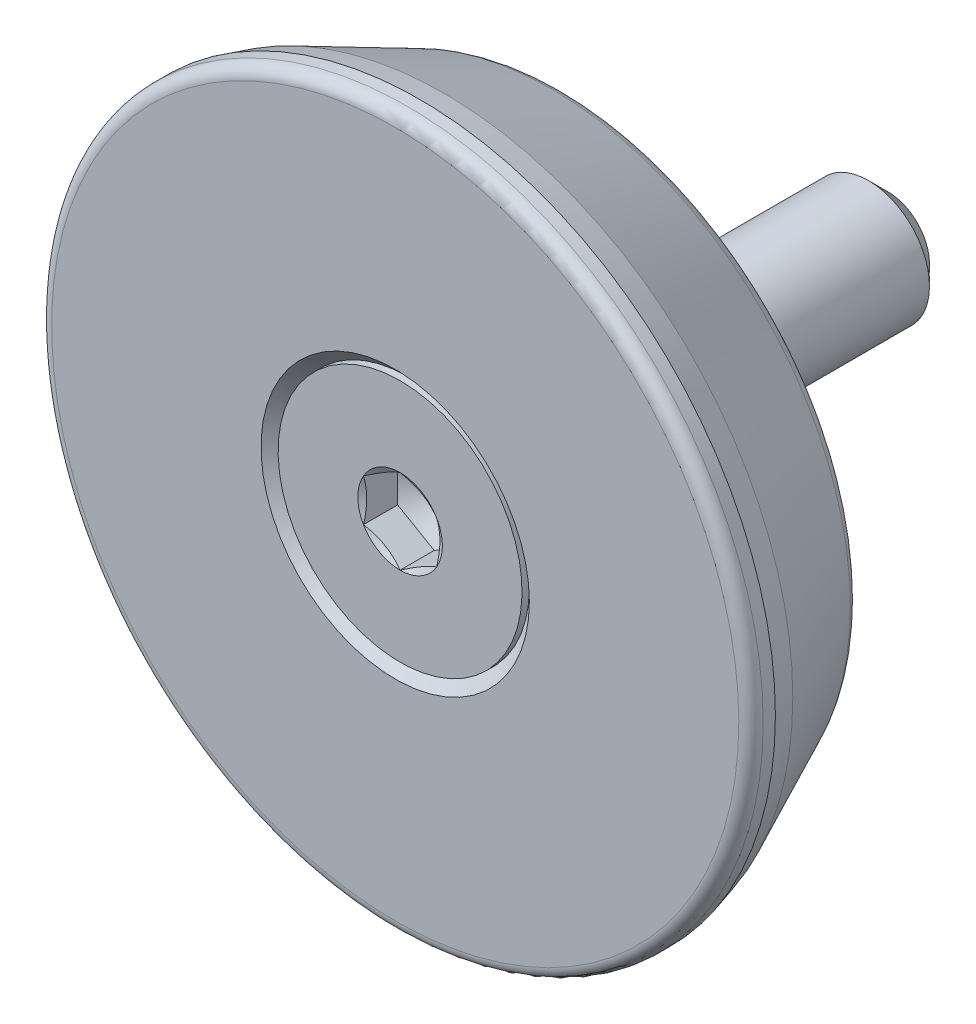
ISO-10303-21;
HEADER;
FILE_DESCRIPTION(('STEP AP214'),'2;1');
FILE_NAME('part.step','',(''),(''),'','','');
FILE_SCHEMA(('AUTOMOTIVE_DESIGN { 1 0 10303 214 1 1 1 1 }'));
ENDSEC;
DATA;
#1=APPLICATION_CONTEXT('core data for automotive mechanical design processes');
#2=APPLICATION_PROTOCOL_DEFINITION('international standard','automotive_design',2000,#1);
#3=PRODUCT_CONTEXT('',#1,'mechanical');
#4=PRODUCT('Part','Part','',(#3));
#5=PRODUCT_RELATED_PRODUCT_CATEGORY('part','',(#4));
#6=PRODUCT_DEFINITION_FORMATION('','',#4);
#7=PRODUCT_DEFINITION_CONTEXT('part definition',#1,'design');
#8=PRODUCT_DEFINITION('design','',#6,#7);
#9=PRODUCT_DEFINITION_SHAPE('','',#8);
#10=(LENGTH_UNIT() NAMED_UNIT(*) SI_UNIT(.MILLI.,.METRE.));
#11=(NAMED_UNIT(*) PLANE_ANGLE_UNIT() SI_UNIT($,.RADIAN.));
#12=(NAMED_UNIT(*) SI_UNIT($,.STERADIAN.) SOLID_ANGLE_UNIT());
#13=UNCERTAINTY_MEASURE_WITH_UNIT(LENGTH_MEASURE(1.E-05),#10,'distance_accuracy_value','');
#14=(GEOMETRIC_REPRESENTATION_CONTEXT(3) GLOBAL_UNCERTAINTY_ASSIGNED_CONTEXT((#13)) GLOBAL_UNIT_ASSIGNED_CONTEXT((#10,
#11,#12)) REPRESENTATION_CONTEXT('',''));
#15=CARTESIAN_POINT('',(0.,0.,0.));
#16=DIRECTION('',(0.,0.,1.));
#17=DIRECTION('',(1.,0.,0.));
#18=AXIS2_PLACEMENT_3D('',#15,#16,#17);
#19=CARTESIAN_POINT('',(0.,0.,-2.05000000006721));
#20=DIRECTION('',(0.,0.,1.));
#21=DIRECTION('',(0.,1.,0.));
#22=AXIS2_PLACEMENT_3D('',#19,#20,#21);
#23=CONICAL_SURFACE('',#22,1.73205080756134,1.04719755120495);
#24=CARTESIAN_POINT('',(0.,0.,-2.05000000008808));
#25=DIRECTION('',(0.,0.,1.));
#26=DIRECTION('',(0.,1.,0.));
#27=AXIS2_PLACEMENT_3D('',#24,#25,#26);
#28=CIRCLE('',#27,1.7320508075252);
#29=CARTESIAN_POINT('',(-1.49999999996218,-0.86602540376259,-2.05000000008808));
#30=VERTEX_POINT('',#29);
#31=CARTESIAN_POINT('',(0.,-1.73205080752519,-2.05000000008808));
#32=VERTEX_POINT('',#31);
#33=EDGE_CURVE('E452',#30,#32,#28,.T.);
#34=ORIENTED_EDGE('',*,*,#33,.T.);
#35=CARTESIAN_POINT('',(0.,0.,-2.05000000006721));
#36=DIRECTION('',(0.,0.,1.));
#37=DIRECTION('',(0.,1.,0.));
#38=AXIS2_PLACEMENT_3D('',#35,#36,#37);
#39=CIRCLE('',#38,1.73205080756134);
#40=CARTESIAN_POINT('',(1.5,-0.866025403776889,-2.05000000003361));
#41=VERTEX_POINT('',#40);
#42=EDGE_CURVE('E842',#41,#32,#39,.F.);
#43=ORIENTED_EDGE('',*,*,#42,.F.);
#44=CARTESIAN_POINT('',(0.,0.,-2.05000000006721));
#45=DIRECTION('',(0.,0.,1.));
#46=DIRECTION('',(0.,1.,0.));
#47=AXIS2_PLACEMENT_3D('',#44,#45,#46);
#48=CIRCLE('',#47,1.73205080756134);
#49=CARTESIAN_POINT('',(1.5,0.866025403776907,-2.05000000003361));
#50=VERTEX_POINT('',#49);
#51=EDGE_CURVE('E839',#50,#41,#48,.F.);
#52=ORIENTED_EDGE('',*,*,#51,.F.);
#53=CARTESIAN_POINT('',(0.,0.,-2.05000000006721));
#54=DIRECTION('',(0.,0.,1.));
#55=DIRECTION('',(0.,1.,0.));
#56=AXIS2_PLACEMENT_3D('',#53,#54,#55);
#57=CIRCLE('',#56,1.73205080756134);
#58=CARTESIAN_POINT('',(6.52634710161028E-12,1.73205080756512,-2.05000000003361));
#59=VERTEX_POINT('',#58);
#60=EDGE_CURVE('E447',#59,#50,#57,.F.);
#61=ORIENTED_EDGE('',*,*,#60,.F.);
#62=CARTESIAN_POINT('',(0.,0.,-2.05000000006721));
#63=DIRECTION('',(0.,0.,1.));
#64=DIRECTION('',(0.,1.,0.));
#65=AXIS2_PLACEMENT_3D('',#62,#63,#64);
#66=CIRCLE('',#65,1.73205080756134);
#67=CARTESIAN_POINT('',(-1.5,0.866025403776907,-2.05000000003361));
#68=VERTEX_POINT('',#67);
#69=EDGE_CURVE('E647',#68,#59,#66,.F.);
#70=ORIENTED_EDGE('',*,*,#69,.F.);
#71=CARTESIAN_POINT('',(0.,0.,-2.05000000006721));
#72=DIRECTION('',(0.,0.,1.));
#73=DIRECTION('',(0.,1.,0.));
#74=AXIS2_PLACEMENT_3D('',#71,#72,#73);
#75=CIRCLE('',#74,1.73205080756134);
#76=EDGE_CURVE('E844',#30,#68,#75,.F.);
#77=ORIENTED_EDGE('',*,*,#76,.F.);
#78=EDGE_LOOP('',(#34,#43,#52,#61,#70,#77));
#79=FACE_BOUND('',#78,.T.);
#80=CARTESIAN_POINT('',(0.,-2.84127416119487E-11,-3.05000000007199));
#81=VERTEX_POINT('',#80);
#82=VERTEX_LOOP('',#81);
#83=FACE_BOUND('',#82,.T.);
#84=ADVANCED_FACE('F14',(#79,#83),#23,.F.);
#85=CARTESIAN_POINT('',(0.,0.,-2.05));
#86=DIRECTION('',(0.,0.,1.));
#87=DIRECTION('',(0.,1.,0.));
#88=AXIS2_PLACEMENT_3D('',#85,#86,#87);
#89=PLANE('',#88);
#90=ORIENTED_EDGE('',*,*,#51,.T.);
#91=DIRECTION('',(0.,1.,0.));
#92=VECTOR('',#91,1.);
#93=CARTESIAN_POINT('',(1.5,0.,-2.05));
#94=LINE('',#93,#92);
#95=EDGE_CURVE('E428',#50,#41,#94,.F.);
#96=ORIENTED_EDGE('',*,*,#95,.F.);
#97=EDGE_LOOP('',(#90,#96));
#98=FACE_BOUND('',#97,.T.);
#99=ADVANCED_FACE('F609',(#98),#89,.F.);
#100=CARTESIAN_POINT('',(0.,0.,-2.05));
#101=DIRECTION('',(0.,0.,1.));
#102=DIRECTION('',(0.,1.,0.));
#103=AXIS2_PLACEMENT_3D('',#100,#101,#102);
#104=PLANE('',#103);
#105=ORIENTED_EDGE('',*,*,#60,.T.);
#106=DIRECTION('',(0.866025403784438,-0.5,0.));
#107=VECTOR('',#106,1.);
#108=CARTESIAN_POINT('',(0.,1.73205080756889,-2.05));
#109=LINE('',#108,#107);
#110=EDGE_CURVE('E424',#59,#50,#109,.T.);
#111=ORIENTED_EDGE('',*,*,#110,.F.);
#112=EDGE_LOOP('',(#105,#111));
#113=FACE_BOUND('',#112,.T.);
#114=ADVANCED_FACE('F616',(#113),#104,.F.);
#115=CARTESIAN_POINT('',(0.,0.,-2.05));
#116=DIRECTION('',(0.,0.,1.));
#117=DIRECTION('',(0.,1.,0.));
#118=AXIS2_PLACEMENT_3D('',#115,#116,#117);
#119=PLANE('',#118);
#120=ORIENTED_EDGE('',*,*,#69,.T.);
#121=DIRECTION('',(0.866025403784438,0.5,0.));
#122=VECTOR('',#121,1.);
#123=CARTESIAN_POINT('',(-1.5,0.866025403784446,-2.05));
#124=LINE('',#123,#122);
#125=EDGE_CURVE('E444',#68,#59,#124,.T.);
#126=ORIENTED_EDGE('',*,*,#125,.F.);
#127=EDGE_LOOP('',(#120,#126));
#128=FACE_BOUND('',#127,.T.);
#129=ADVANCED_FACE('F622',(#128),#119,.F.);
#130=CARTESIAN_POINT('',(0.,0.,-2.05));
#131=DIRECTION('',(0.,0.,1.));
#132=DIRECTION('',(0.,1.,0.));
#133=AXIS2_PLACEMENT_3D('',#130,#131,#132);
#134=PLANE('',#133);
#135=ORIENTED_EDGE('',*,*,#76,.T.);
#136=DIRECTION('',(0.,1.,0.));
#137=VECTOR('',#136,1.);
#138=CARTESIAN_POINT('',(-1.5,0.,-2.05));
#139=LINE('',#138,#137);
#140=EDGE_CURVE('E441',#30,#68,#139,.T.);
#141=ORIENTED_EDGE('',*,*,#140,.F.);
#142=EDGE_LOOP('',(#135,#141));
#143=FACE_BOUND('',#142,.T.);
#144=ADVANCED_FACE('F627',(#143),#134,.F.);
#145=CARTESIAN_POINT('',(0.,0.,-2.05));
#146=DIRECTION('',(0.,0.,1.));
#147=DIRECTION('',(0.,1.,0.));
#148=AXIS2_PLACEMENT_3D('',#145,#146,#147);
#149=PLANE('',#148);
#150=ORIENTED_EDGE('',*,*,#33,.F.);
#151=DIRECTION('',(0.866025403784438,-0.5,0.));
#152=VECTOR('',#151,1.);
#153=CARTESIAN_POINT('',(-1.5,-0.866025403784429,-2.05));
#154=LINE('',#153,#152);
#155=EDGE_CURVE('E464',#32,#30,#154,.F.);
#156=ORIENTED_EDGE('',*,*,#155,.F.);
#157=EDGE_LOOP('',(#150,#156));
#158=FACE_BOUND('',#157,.T.);
#159=ADVANCED_FACE('F624',(#158),#149,.F.);
#160=CARTESIAN_POINT('',(0.,0.,-2.05));
#161=DIRECTION('',(0.,0.,1.));
#162=DIRECTION('',(0.,1.,0.));
#163=AXIS2_PLACEMENT_3D('',#160,#161,#162);
#164=PLANE('',#163);
#165=ORIENTED_EDGE('',*,*,#42,.T.);
#166=DIRECTION('',(-0.866025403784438,-0.5,0.));
#167=VECTOR('',#166,1.);
#168=CARTESIAN_POINT('',(1.5,-0.86602540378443,-2.05));
#169=LINE('',#168,#167);
#170=EDGE_CURVE('E436',#41,#32,#169,.T.);
#171=ORIENTED_EDGE('',*,*,#170,.F.);
#172=EDGE_LOOP('',(#165,#171));
#173=FACE_BOUND('',#172,.T.);
#174=ADVANCED_FACE('F626',(#173),#164,.F.);
#175=CARTESIAN_POINT('',(1.5,-0.86602540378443,-3.45));
#176=DIRECTION('',(-1.,0.,0.));
#177=DIRECTION('',(0.,1.,0.));
#178=AXIS2_PLACEMENT_3D('',#175,#176,#177);
#179=PLANE('',#178);
#180=DIRECTION('',(0.,0.,-1.));
#181=VECTOR('',#180,1.);
#182=CARTESIAN_POINT('',(1.5,-0.866025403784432,-3.45));
#183=LINE('',#182,#181);
#184=CARTESIAN_POINT('',(1.49999999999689,-0.866025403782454,-0.650000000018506));
#185=VERTEX_POINT('',#184);
#186=EDGE_CURVE('E456',#185,#41,#183,.T.);
#187=ORIENTED_EDGE('',*,*,#186,.F.);
#188=CARTESIAN_POINT('',(1.5,-0.866025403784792,-0.650000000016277));
#189=CARTESIAN_POINT('',(1.50000000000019,-0.794933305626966,-0.670524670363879));
#190=CARTESIAN_POINT('',(1.5000000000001,-0.723278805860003,-0.689315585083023));
#191=CARTESIAN_POINT('',(1.4999999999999,-0.578805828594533,-0.722526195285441));
#192=CARTESIAN_POINT('',(1.49999999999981,-0.505985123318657,-0.736936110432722));
#193=CARTESIAN_POINT('',(1.50000000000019,-0.361160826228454,-0.760108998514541));
#194=CARTESIAN_POINT('',(1.50000000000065,-0.289177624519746,-0.768995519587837));
#195=CARTESIAN_POINT('',(1.49999999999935,-0.144795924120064,-0.78092514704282));
#196=CARTESIAN_POINT('',(1.4999999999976,-0.0723979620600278,-0.783974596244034));
#197=CARTESIAN_POINT('',(1.4999999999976,0.0723979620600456,-0.783974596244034));
#198=CARTESIAN_POINT('',(1.49999999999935,0.144795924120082,-0.78092514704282));
#199=CARTESIAN_POINT('',(1.50000000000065,0.289177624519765,-0.768995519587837));
#200=CARTESIAN_POINT('',(1.50000000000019,0.361160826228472,-0.760108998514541));
#201=CARTESIAN_POINT('',(1.49999999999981,0.505985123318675,-0.736936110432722));
#202=CARTESIAN_POINT('',(1.49999999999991,0.578805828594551,-0.722526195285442));
#203=CARTESIAN_POINT('',(1.5000000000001,0.723278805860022,-0.689315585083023));
#204=CARTESIAN_POINT('',(1.50000000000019,0.794933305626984,-0.670524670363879));
#205=CARTESIAN_POINT('',(1.5,0.86602540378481,-0.650000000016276));
#206=B_SPLINE_CURVE_WITH_KNOTS('',3,(#188,#189,#190,#191,#192,#193,#194,#195,#196,#197,#198,
#199,#200,#201,#202,#203,#204,#205),.UNSPECIFIED.,.F.,.F.,(4,2,2,2,2,2,2,2,4),(0.,
0.22205504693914,0.444602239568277,0.661973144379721,0.87910770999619,1.09624227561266,
1.3136131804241,1.53616037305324,1.75821541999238),.UNSPECIFIED.);
#207=CARTESIAN_POINT('',(1.49999999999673,0.866025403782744,-0.650000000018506));
#208=VERTEX_POINT('',#207);
#209=EDGE_CURVE('E578',#185,#208,#206,.T.);
#210=ORIENTED_EDGE('',*,*,#209,.T.);
#211=DIRECTION('',(0.,0.,-1.));
#212=VECTOR('',#211,1.);
#213=CARTESIAN_POINT('',(1.5,0.866025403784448,-3.45));
#214=LINE('',#213,#212);
#215=EDGE_CURVE('E454',#208,#50,#214,.T.);
#216=ORIENTED_EDGE('',*,*,#215,.T.);
#217=ORIENTED_EDGE('',*,*,#95,.T.);
#218=EDGE_LOOP('',(#187,#210,#216,#217));
#219=FACE_BOUND('',#218,.T.);
#220=ADVANCED_FACE('F570',(#219),#179,.T.);
#221=CARTESIAN_POINT('',(1.5,0.866025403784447,-3.45));
#222=DIRECTION('',(-0.5,-0.866025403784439,0.));
#223=DIRECTION('',(-0.866025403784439,0.5,0.));
#224=AXIS2_PLACEMENT_3D('',#221,#222,#223);
#225=PLANE('',#224);
#226=ORIENTED_EDGE('',*,*,#110,.T.);
#227=ORIENTED_EDGE('',*,*,#215,.F.);
#228=CARTESIAN_POINT('',(1.50000000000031,0.866025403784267,-0.650000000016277));
#229=CARTESIAN_POINT('',(1.43843243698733,0.901571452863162,-0.670524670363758));
#230=CARTESIAN_POINT('',(1.37637781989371,0.937398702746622,-0.689315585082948));
#231=CARTESIAN_POINT('',(1.25126055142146,1.00963519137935,-0.722526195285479));
#232=CARTESIAN_POINT('',(1.18819597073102,1.0460455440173,-0.736936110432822));
#233=CARTESIAN_POINT('',(1.06277445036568,1.1184576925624,-0.760108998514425));
#234=CARTESIAN_POINT('',(1.00043516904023,1.15444929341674,-0.768995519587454));
#235=CARTESIAN_POINT('',(0.875396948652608,1.22664014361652,-0.780925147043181));
#236=CARTESIAN_POINT('',(0.812698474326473,1.2628391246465,-0.783974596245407));
#237=CARTESIAN_POINT('',(0.687301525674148,1.33523708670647,-0.783974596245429));
#238=CARTESIAN_POINT('',(0.624603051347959,1.37143606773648,-0.78092514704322));
#239=CARTESIAN_POINT('',(0.499564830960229,1.44362691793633,-0.768995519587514));
#240=CARTESIAN_POINT('',(0.437225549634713,1.4796185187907,-0.76010899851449));
#241=CARTESIAN_POINT('',(0.311804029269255,1.55203066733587,-0.736936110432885));
#242=CARTESIAN_POINT('',(0.248739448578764,1.58844101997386,-0.722526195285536));
#243=CARTESIAN_POINT('',(0.123622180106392,1.66067750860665,-0.689315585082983));
#244=CARTESIAN_POINT('',(0.0615675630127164,1.69650475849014,-0.670524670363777));
#245=CARTESIAN_POINT('',(-3.2178788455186E-13,1.73205080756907,-0.650000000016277));
#246=B_SPLINE_CURVE_WITH_KNOTS('',3,(#228,#229,#230,#231,#232,#233,#234,#235,#236,#237,#238,
#239,#240,#241,#242,#243,#244,#245),.UNSPECIFIED.,.F.,.F.,(4,2,2,2,2,2,2,2,4),(0.,
0.222055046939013,0.444602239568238,0.661973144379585,0.879107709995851,1.09624227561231,
1.31361318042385,1.53616037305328,1.7582154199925),.UNSPECIFIED.);
#247=CARTESIAN_POINT('',(1.49361831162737E-13,1.73205080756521,-0.650000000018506));
#248=VERTEX_POINT('',#247);
#249=EDGE_CURVE('E572',#208,#248,#246,.T.);
#250=ORIENTED_EDGE('',*,*,#249,.T.);
#251=DIRECTION('',(0.,0.,-1.));
#252=VECTOR('',#251,1.);
#253=CARTESIAN_POINT('',(0.,1.73205080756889,-3.45));
#254=LINE('',#253,#252);
#255=EDGE_CURVE('E451',#248,#59,#254,.T.);
#256=ORIENTED_EDGE('',*,*,#255,.T.);
#257=EDGE_LOOP('',(#226,#227,#250,#256));
#258=FACE_BOUND('',#257,.T.);
#259=ADVANCED_FACE('F566',(#258),#225,.T.);
#260=CARTESIAN_POINT('',(0.,1.73205080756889,-3.45));
#261=DIRECTION('',(0.5,-0.866025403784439,0.));
#262=DIRECTION('',(-0.866025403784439,-0.5,0.));
#263=AXIS2_PLACEMENT_3D('',#260,#261,#262);
#264=PLANE('',#263);
#265=ORIENTED_EDGE('',*,*,#125,.T.);
#266=ORIENTED_EDGE('',*,*,#255,.F.);
#267=CARTESIAN_POINT('',(3.05147795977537E-13,1.73205080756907,-0.650000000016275));
#268=CARTESIAN_POINT('',(-0.0615675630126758,1.69650475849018,-0.670524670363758));
#269=CARTESIAN_POINT('',(-0.123622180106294,1.66067750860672,-0.689315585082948));
#270=CARTESIAN_POINT('',(-0.248739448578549,1.58844101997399,-0.722526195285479));
#271=CARTESIAN_POINT('',(-0.31180402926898,1.55203066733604,-0.736936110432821));
#272=CARTESIAN_POINT('',(-0.437225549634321,1.47961851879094,-0.760108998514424));
#273=CARTESIAN_POINT('',(-0.499564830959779,1.4436269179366,-0.768995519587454));
#274=CARTESIAN_POINT('',(-0.624603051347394,1.37143606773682,-0.78092514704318));
#275=CARTESIAN_POINT('',(-0.687301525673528,1.33523708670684,-0.783974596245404));
#276=CARTESIAN_POINT('',(-0.812698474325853,1.26283912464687,-0.783974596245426));
#277=CARTESIAN_POINT('',(-0.875396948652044,1.22664014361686,-0.780925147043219));
#278=CARTESIAN_POINT('',(-1.00043516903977,1.15444929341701,-0.768995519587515));
#279=CARTESIAN_POINT('',(-1.06277445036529,1.11845769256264,-0.76010899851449));
#280=CARTESIAN_POINT('',(-1.18819597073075,1.04604554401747,-0.736936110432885));
#281=CARTESIAN_POINT('',(-1.25126055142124,1.00963519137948,-0.722526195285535));
#282=CARTESIAN_POINT('',(-1.37637781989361,0.93739870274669,-0.689315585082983));
#283=CARTESIAN_POINT('',(-1.43843243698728,0.901571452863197,-0.670524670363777));
#284=CARTESIAN_POINT('',(-1.50000000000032,0.866025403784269,-0.650000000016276));
#285=B_SPLINE_CURVE_WITH_KNOTS('',3,(#267,#268,#269,#270,#271,#272,#273,#274,#275,#276,#277,
#278,#279,#280,#281,#282,#283,#284),.UNSPECIFIED.,.F.,.F.,(4,2,2,2,2,2,2,2,4),(0.,
0.222055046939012,0.444602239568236,0.661973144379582,0.879107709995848,1.09624227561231,
1.31361318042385,1.53616037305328,1.75821541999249),.UNSPECIFIED.);
#286=CARTESIAN_POINT('',(-1.4999999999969,0.866025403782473,-0.650000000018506));
#287=VERTEX_POINT('',#286);
#288=EDGE_CURVE('E549',#248,#287,#285,.T.);
#289=ORIENTED_EDGE('',*,*,#288,.T.);
#290=DIRECTION('',(0.,0.,-1.));
#291=VECTOR('',#290,1.);
#292=CARTESIAN_POINT('',(-1.5,0.86602540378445,-3.45));
#293=LINE('',#292,#291);
#294=EDGE_CURVE('E448',#287,#68,#293,.T.);
#295=ORIENTED_EDGE('',*,*,#294,.T.);
#296=EDGE_LOOP('',(#265,#266,#289,#295));
#297=FACE_BOUND('',#296,.T.);
#298=ADVANCED_FACE('F560',(#297),#264,.T.);
#299=CARTESIAN_POINT('',(-1.5,0.866025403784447,-3.45));
#300=DIRECTION('',(1.,0.,0.));
#301=DIRECTION('',(0.,0.,-1.));
#302=AXIS2_PLACEMENT_3D('',#299,#300,#301);
#303=PLANE('',#302);
#304=ORIENTED_EDGE('',*,*,#140,.T.);
#305=ORIENTED_EDGE('',*,*,#294,.F.);
#306=CARTESIAN_POINT('',(-1.5,0.86602540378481,-0.650000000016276));
#307=CARTESIAN_POINT('',(-1.5,0.794933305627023,-0.670524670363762));
#308=CARTESIAN_POINT('',(-1.5,0.723278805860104,-0.689315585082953));
#309=CARTESIAN_POINT('',(-1.5,0.57880582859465,-0.722526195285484));
#310=CARTESIAN_POINT('',(-1.5,0.505985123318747,-0.736936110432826));
#311=CARTESIAN_POINT('',(-1.5,0.361160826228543,-0.76010899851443));
#312=CARTESIAN_POINT('',(-1.5,0.289177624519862,-0.768995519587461));
#313=CARTESIAN_POINT('',(-1.5,0.144795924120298,-0.780925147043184));
#314=CARTESIAN_POINT('',(-1.5,0.0723979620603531,-0.783974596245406));
#315=CARTESIAN_POINT('',(-1.5,-0.0723979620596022,-0.783974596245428));
#316=CARTESIAN_POINT('',(-1.5,-0.144795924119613,-0.780925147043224));
#317=CARTESIAN_POINT('',(-1.5,-0.289177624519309,-0.768995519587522));
#318=CARTESIAN_POINT('',(-1.5,-0.361160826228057,-0.760108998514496));
#319=CARTESIAN_POINT('',(-1.5,-0.505985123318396,-0.73693611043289));
#320=CARTESIAN_POINT('',(-1.5,-0.578805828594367,-0.722526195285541));
#321=CARTESIAN_POINT('',(-1.5,-0.723278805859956,-0.689315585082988));
#322=CARTESIAN_POINT('',(-1.5,-0.794933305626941,-0.670524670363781));
#323=CARTESIAN_POINT('',(-1.5,-0.866025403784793,-0.650000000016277));
#324=B_SPLINE_CURVE_WITH_KNOTS('',3,(#306,#307,#308,#309,#310,#311,#312,#313,#314,#315,#316,
#317,#318,#319,#320,#321,#322,#323),.UNSPECIFIED.,.F.,.F.,(4,2,2,2,2,2,2,2,4),(0.,
0.222055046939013,0.444602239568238,0.661973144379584,0.87910770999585,1.09624227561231,
1.31361318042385,1.53616037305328,1.7582154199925),.UNSPECIFIED.);
#325=CARTESIAN_POINT('',(-1.49999999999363,-0.866025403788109,-0.650000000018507));
#326=VERTEX_POINT('',#325);
#327=EDGE_CURVE('E474',#287,#326,#324,.T.);
#328=ORIENTED_EDGE('',*,*,#327,.T.);
#329=DIRECTION('',(0.,0.,-1.));
#330=VECTOR('',#329,1.);
#331=CARTESIAN_POINT('',(-1.5,-0.86602540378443,-3.45));
#332=LINE('',#331,#330);
#333=EDGE_CURVE('E460',#30,#326,#332,.F.);
#334=ORIENTED_EDGE('',*,*,#333,.F.);
#335=EDGE_LOOP('',(#304,#305,#328,#334));
#336=FACE_BOUND('',#335,.T.);
#337=ADVANCED_FACE('F522',(#336),#303,.T.);
#338=CARTESIAN_POINT('',(-1.5,-0.866025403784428,-3.45));
#339=DIRECTION('',(0.5,0.866025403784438,0.));
#340=DIRECTION('',(0.866025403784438,-0.5,0.));
#341=AXIS2_PLACEMENT_3D('',#338,#339,#340);
#342=PLANE('',#341);
#343=ORIENTED_EDGE('',*,*,#333,.T.);
#344=CARTESIAN_POINT('',(-1.50000000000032,-0.866025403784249,-0.650000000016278));
#345=CARTESIAN_POINT('',(-1.4384324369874,-0.901571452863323,-0.670524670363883));
#346=CARTESIAN_POINT('',(-1.3763778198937,-0.937398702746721,-0.689315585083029));
#347=CARTESIAN_POINT('',(-1.25126055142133,-1.00963519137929,-0.722526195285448));
#348=CARTESIAN_POINT('',(-1.18819597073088,-1.04604554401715,-0.736936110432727));
#349=CARTESIAN_POINT('',(-1.06277445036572,-1.11845769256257,-0.760108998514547));
#350=CARTESIAN_POINT('',(-1.00043516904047,-1.15444929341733,-0.768995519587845));
#351=CARTESIAN_POINT('',(-0.87539694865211,-1.22664014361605,-0.780925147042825));
#352=CARTESIAN_POINT('',(-0.812698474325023,-1.26283912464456,-0.783974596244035));
#353=CARTESIAN_POINT('',(-0.687301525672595,-1.33523708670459,-0.783974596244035));
#354=CARTESIAN_POINT('',(-0.624603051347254,-1.37143606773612,-0.780925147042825));
#355=CARTESIAN_POINT('',(-0.499564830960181,-1.44362691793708,-0.768995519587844));
#356=CARTESIAN_POINT('',(-0.437225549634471,-1.47961851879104,-0.760108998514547));
#357=CARTESIAN_POINT('',(-0.311804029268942,-1.55203066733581,-0.736936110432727));
#358=CARTESIAN_POINT('',(-0.248739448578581,-1.58844101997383,-0.722526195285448));
#359=CARTESIAN_POINT('',(-0.123622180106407,-1.66067750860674,-0.689315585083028));
#360=CARTESIAN_POINT('',(-0.0615675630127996,-1.6965047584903,-0.670524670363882));
#361=CARTESIAN_POINT('',(3.08045989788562E-13,-1.73205080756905,-0.650000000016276));
#362=B_SPLINE_CURVE_WITH_KNOTS('',3,(#344,#345,#346,#347,#348,#349,#350,#351,#352,#353,#354,
#355,#356,#357,#358,#359,#360,#361),.UNSPECIFIED.,.F.,.F.,(4,2,2,2,2,2,2,2,4),(0.,
0.222055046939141,0.444602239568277,0.661973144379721,0.87910770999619,1.09624227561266,
1.3136131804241,1.53616037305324,1.75821541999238),.UNSPECIFIED.);
#363=CARTESIAN_POINT('',(-1.62476175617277E-13,-1.73205080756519,-0.650000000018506));
#364=VERTEX_POINT('',#363);
#365=EDGE_CURVE('E471',#326,#364,#362,.T.);
#366=ORIENTED_EDGE('',*,*,#365,.T.);
#367=DIRECTION('',(0.,0.,-1.));
#368=VECTOR('',#367,1.);
#369=CARTESIAN_POINT('',(0.,-1.73205080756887,-3.45));
#370=LINE('',#369,#368);
#371=EDGE_CURVE('E459',#364,#32,#370,.T.);
#372=ORIENTED_EDGE('',*,*,#371,.T.);
#373=ORIENTED_EDGE('',*,*,#155,.T.);
#374=EDGE_LOOP('',(#343,#366,#372,#373));
#375=FACE_BOUND('',#374,.T.);
#376=ADVANCED_FACE('F517',(#375),#342,.T.);
#377=CARTESIAN_POINT('',(0.,-1.73205080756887,-3.45));
#378=DIRECTION('',(-0.5,0.866025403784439,0.));
#379=DIRECTION('',(0.866025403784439,0.5,0.));
#380=AXIS2_PLACEMENT_3D('',#377,#378,#379);
#381=PLANE('',#380);
#382=ORIENTED_EDGE('',*,*,#371,.F.);
#383=CARTESIAN_POINT('',(-3.18707337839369E-13,-1.73205080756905,-0.650000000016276));
#384=CARTESIAN_POINT('',(0.0615675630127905,-1.6965047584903,-0.670524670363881));
#385=CARTESIAN_POINT('',(0.123622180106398,-1.66067750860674,-0.689315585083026));
#386=CARTESIAN_POINT('',(0.248739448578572,-1.58844101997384,-0.722526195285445));
#387=CARTESIAN_POINT('',(0.311804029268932,-1.55203066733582,-0.736936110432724));
#388=CARTESIAN_POINT('',(0.437225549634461,-1.47961851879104,-0.760108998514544));
#389=CARTESIAN_POINT('',(0.499564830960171,-1.44362691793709,-0.768995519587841));
#390=CARTESIAN_POINT('',(0.624603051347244,-1.37143606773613,-0.780925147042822));
#391=CARTESIAN_POINT('',(0.687301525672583,-1.33523708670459,-0.783974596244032));
#392=CARTESIAN_POINT('',(0.812698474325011,-1.26283912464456,-0.783974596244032));
#393=CARTESIAN_POINT('',(0.8753969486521,-1.22664014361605,-0.780925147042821));
#394=CARTESIAN_POINT('',(1.00043516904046,-1.15444929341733,-0.768995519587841));
#395=CARTESIAN_POINT('',(1.06277445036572,-1.11845769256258,-0.760108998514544));
#396=CARTESIAN_POINT('',(1.18819597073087,-1.04604554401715,-0.736936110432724));
#397=CARTESIAN_POINT('',(1.25126055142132,-1.0096351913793,-0.722526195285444));
#398=CARTESIAN_POINT('',(1.37637781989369,-0.937398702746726,-0.689315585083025));
#399=CARTESIAN_POINT('',(1.43843243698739,-0.901571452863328,-0.67052467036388));
#400=CARTESIAN_POINT('',(1.50000000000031,-0.866025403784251,-0.650000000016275));
#401=B_SPLINE_CURVE_WITH_KNOTS('',3,(#383,#384,#385,#386,#387,#388,#389,#390,#391,#392,#393,
#394,#395,#396,#397,#398,#399,#400),.UNSPECIFIED.,.F.,.F.,(4,2,2,2,2,2,2,2,4),(0.,
0.222055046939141,0.444602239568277,0.66197314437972,0.87910770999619,1.09624227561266,
1.3136131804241,1.53616037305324,1.75821541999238),.UNSPECIFIED.);
#402=EDGE_CURVE('E506',#364,#185,#401,.T.);
#403=ORIENTED_EDGE('',*,*,#402,.T.);
#404=ORIENTED_EDGE('',*,*,#186,.T.);
#405=ORIENTED_EDGE('',*,*,#170,.T.);
#406=EDGE_LOOP('',(#382,#403,#404,#405));
#407=FACE_BOUND('',#406,.T.);
#408=ADVANCED_FACE('F521',(#407),#381,.T.);
#409=CARTESIAN_POINT('',(0.,0.,-0.650000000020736));
#410=DIRECTION('',(0.,0.,1.));
#411=DIRECTION('',(0.,1.,0.));
#412=AXIS2_PLACEMENT_3D('',#409,#410,#411);
#413=CONICAL_SURFACE('',#412,1.73205080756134,1.04719755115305);
#414=ORIENTED_EDGE('',*,*,#209,.F.);
#415=CARTESIAN_POINT('',(0.,0.,-0.650000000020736));
#416=DIRECTION('',(0.,0.,1.));
#417=DIRECTION('',(0.,1.,0.));
#418=AXIS2_PLACEMENT_3D('',#415,#416,#417);
#419=CIRCLE('',#418,1.73205080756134);
#420=EDGE_CURVE('E487',#208,#185,#419,.F.);
#421=ORIENTED_EDGE('',*,*,#420,.F.);
#422=EDGE_LOOP('',(#414,#421));
#423=FACE_BOUND('',#422,.T.);
#424=ADVANCED_FACE('F587',(#423),#413,.F.);
#425=CARTESIAN_POINT('',(0.,0.,-0.650000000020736));
#426=DIRECTION('',(0.,0.,1.));
#427=DIRECTION('',(0.,1.,0.));
#428=AXIS2_PLACEMENT_3D('',#425,#426,#427);
#429=CONICAL_SURFACE('',#428,1.73205080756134,1.04719755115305);
#430=CARTESIAN_POINT('',(0.,0.,-0.650000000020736));
#431=DIRECTION('',(0.,0.,1.));
#432=DIRECTION('',(0.,1.,0.));
#433=AXIS2_PLACEMENT_3D('',#430,#431,#432);
#434=CIRCLE('',#433,1.73205080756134);
#435=EDGE_CURVE('E490',#248,#208,#434,.F.);
#436=ORIENTED_EDGE('',*,*,#435,.F.);
#437=ORIENTED_EDGE('',*,*,#249,.F.);
#438=EDGE_LOOP('',(#436,#437));
#439=FACE_BOUND('',#438,.T.);
#440=ADVANCED_FACE('F584',(#439),#429,.F.);
#441=CARTESIAN_POINT('',(0.,0.,-0.650000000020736));
#442=DIRECTION('',(0.,0.,1.));
#443=DIRECTION('',(0.,1.,0.));
#444=AXIS2_PLACEMENT_3D('',#441,#442,#443);
#445=CONICAL_SURFACE('',#444,1.73205080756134,1.04719755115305);
#446=CARTESIAN_POINT('',(0.,0.,-0.650000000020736));
#447=DIRECTION('',(0.,0.,1.));
#448=DIRECTION('',(0.,1.,0.));
#449=AXIS2_PLACEMENT_3D('',#446,#447,#448);
#450=CIRCLE('',#449,1.73205080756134);
#451=EDGE_CURVE('E493',#287,#248,#450,.F.);
#452=ORIENTED_EDGE('',*,*,#451,.F.);
#453=ORIENTED_EDGE('',*,*,#288,.F.);
#454=EDGE_LOOP('',(#452,#453));
#455=FACE_BOUND('',#454,.T.);
#456=ADVANCED_FACE('F536',(#455),#445,.F.);
#457=CARTESIAN_POINT('',(0.,0.,-0.650000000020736));
#458=DIRECTION('',(0.,0.,1.));
#459=DIRECTION('',(0.,1.,0.));
#460=AXIS2_PLACEMENT_3D('',#457,#458,#459);
#461=CONICAL_SURFACE('',#460,1.73205080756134,1.04719755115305);
#462=CARTESIAN_POINT('',(0.,0.,-0.650000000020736));
#463=DIRECTION('',(0.,0.,1.));
#464=DIRECTION('',(0.,1.,0.));
#465=AXIS2_PLACEMENT_3D('',#462,#463,#464);
#466=CIRCLE('',#465,1.73205080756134);
#467=EDGE_CURVE('E470',#326,#287,#466,.F.);
#468=ORIENTED_EDGE('',*,*,#467,.F.);
#469=ORIENTED_EDGE('',*,*,#327,.F.);
#470=EDGE_LOOP('',(#468,#469));
#471=FACE_BOUND('',#470,.T.);
#472=ADVANCED_FACE('F532',(#471),#461,.F.);
#473=CARTESIAN_POINT('',(0.,0.,-0.650000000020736));
#474=DIRECTION('',(0.,0.,1.));
#475=DIRECTION('',(0.,1.,0.));
#476=AXIS2_PLACEMENT_3D('',#473,#474,#475);
#477=CONICAL_SURFACE('',#476,1.73205080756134,1.04719755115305);
#478=ORIENTED_EDGE('',*,*,#365,.F.);
#479=CARTESIAN_POINT('',(0.,0.,-0.650000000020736));
#480=DIRECTION('',(0.,0.,1.));
#481=DIRECTION('',(0.,1.,0.));
#482=AXIS2_PLACEMENT_3D('',#479,#480,#481);
#483=CIRCLE('',#482,1.73205080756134);
#484=EDGE_CURVE('E481',#364,#326,#483,.F.);
#485=ORIENTED_EDGE('',*,*,#484,.F.);
#486=EDGE_LOOP('',(#478,#485));
#487=FACE_BOUND('',#486,.T.);
#488=ADVANCED_FACE('F514',(#487),#477,.F.);
#489=CARTESIAN_POINT('',(0.,0.,-0.650000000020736));
#490=DIRECTION('',(0.,0.,1.));
#491=DIRECTION('',(0.,1.,0.));
#492=AXIS2_PLACEMENT_3D('',#489,#490,#491);
#493=CONICAL_SURFACE('',#492,1.73205080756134,1.04719755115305);
#494=ORIENTED_EDGE('',*,*,#402,.F.);
#495=CARTESIAN_POINT('',(0.,0.,-0.650000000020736));
#496=DIRECTION('',(0.,0.,1.));
#497=DIRECTION('',(0.,1.,0.));
#498=AXIS2_PLACEMENT_3D('',#495,#496,#497);
#499=CIRCLE('',#498,1.73205080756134);
#500=EDGE_CURVE('E484',#185,#364,#499,.F.);
#501=ORIENTED_EDGE('',*,*,#500,.F.);
#502=EDGE_LOOP('',(#494,#501));
#503=FACE_BOUND('',#502,.T.);
#504=ADVANCED_FACE('F592',(#503),#493,.F.);
#505=CARTESIAN_POINT('',(0.,2.5,-0.65));
#506=DIRECTION('',(0.,0.,1.));
#507=DIRECTION('',(0.,1.,0.));
#508=AXIS2_PLACEMENT_3D('',#505,#506,#507);
#509=PLANE('',#508);
#510=CARTESIAN_POINT('',(0.,0.,-0.65));
#511=DIRECTION('',(0.,0.,1.));
#512=DIRECTION('',(0.,1.,0.));
#513=AXIS2_PLACEMENT_3D('',#510,#511,#512);
#514=CIRCLE('',#513,5.);
#515=CARTESIAN_POINT('',(0.,5.00000000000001,-0.65));
#516=VERTEX_POINT('',#515);
#517=EDGE_CURVE('E477',#516,#516,#514,.T.);
#518=ORIENTED_EDGE('',*,*,#517,.T.);
#519=EDGE_LOOP('',(#518));
#520=FACE_BOUND('',#519,.T.);
#521=ORIENTED_EDGE('',*,*,#500,.T.);
#522=ORIENTED_EDGE('',*,*,#484,.T.);
#523=ORIENTED_EDGE('',*,*,#467,.T.);
#524=ORIENTED_EDGE('',*,*,#451,.T.);
#525=ORIENTED_EDGE('',*,*,#435,.T.);
#526=ORIENTED_EDGE('',*,*,#420,.T.);
#527=EDGE_LOOP('',(#521,#522,#523,#524,#525,#526));
#528=FACE_BOUND('',#527,.T.);
#529=ADVANCED_FACE('F595',(#520,#528),#509,.T.);
#530=CARTESIAN_POINT('',(0.,0.,-0.8));
#531=DIRECTION('',(0.,0.,1.));
#532=DIRECTION('',(0.,1.,0.));
#533=AXIS2_PLACEMENT_3D('',#530,#531,#532);
#534=CYLINDRICAL_SURFACE('',#533,5.);
#535=ORIENTED_EDGE('',*,*,#517,.F.);
#536=EDGE_LOOP('',(#535));
#537=FACE_BOUND('',#536,.T.);
#538=CARTESIAN_POINT('',(0.,0.,-0.95));
#539=DIRECTION('',(0.,0.,1.));
#540=DIRECTION('',(0.,1.,0.));
#541=AXIS2_PLACEMENT_3D('',#538,#539,#540);
#542=CIRCLE('',#541,5.);
#543=CARTESIAN_POINT('',(0.,5.00000000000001,-0.95));
#544=VERTEX_POINT('',#543);
#545=EDGE_CURVE('E467',#544,#544,#542,.T.);
#546=ORIENTED_EDGE('',*,*,#545,.T.);
#547=EDGE_LOOP('',(#546));
#548=FACE_BOUND('',#547,.T.);
#549=ADVANCED_FACE('F603',(#537,#548),#534,.T.);
#550=CARTESIAN_POINT('',(0.,0.,-20.65));
#551=DIRECTION('',(0.,0.,-1.));
#552=DIRECTION('',(0.,-1.,0.));
#553=AXIS2_PLACEMENT_3D('',#550,#551,#552);
#554=PLANE('',#553);
#555=CARTESIAN_POINT('',(0.,0.,-20.65));
#556=DIRECTION('',(0.,0.,-1.));
#557=DIRECTION('',(0.,-1.,0.));
#558=AXIS2_PLACEMENT_3D('',#555,#556,#557);
#559=CIRCLE('',#558,1.7);
#560=CARTESIAN_POINT('',(0.,-1.69999999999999,-20.65));
#561=VERTEX_POINT('',#560);
#562=EDGE_CURVE('E480',#561,#561,#559,.T.);
#563=ORIENTED_EDGE('',*,*,#562,.T.);
#564=EDGE_LOOP('',(#563));
#565=FACE_BOUND('',#564,.T.);
#566=ADVANCED_FACE('F298',(#565),#554,.T.);
#567=CARTESIAN_POINT('',(0.,0.,-20.65));
#568=DIRECTION('',(0.,0.,1.));
#569=DIRECTION('',(0.,1.,0.));
#570=AXIS2_PLACEMENT_3D('',#567,#568,#569);
#571=CONICAL_SURFACE('',#570,1.7,0.785398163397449);
#572=CARTESIAN_POINT('',(0.,0.,-19.85));
#573=DIRECTION('',(0.,0.,-1.));
#574=DIRECTION('',(0.,-1.,0.));
#575=AXIS2_PLACEMENT_3D('',#572,#573,#574);
#576=CIRCLE('',#575,2.5);
#577=CARTESIAN_POINT('',(0.,-2.49999999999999,-19.85));
#578=VERTEX_POINT('',#577);
#579=EDGE_CURVE('E832',#578,#578,#576,.F.);
#580=ORIENTED_EDGE('',*,*,#579,.F.);
#581=EDGE_LOOP('',(#580));
#582=FACE_BOUND('',#581,.T.);
#583=ORIENTED_EDGE('',*,*,#562,.F.);
#584=EDGE_LOOP('',(#583));
#585=FACE_BOUND('',#584,.T.);
#586=ADVANCED_FACE('F1202',(#582,#585),#571,.T.);
#587=CARTESIAN_POINT('',(0.,0.,-7.05));
#588=DIRECTION('',(0.,0.,1.));
#589=DIRECTION('',(0.,1.,0.));
#590=AXIS2_PLACEMENT_3D('',#587,#588,#589);
#591=CYLINDRICAL_SURFACE('',#590,2.5);
#592=DIRECTION('',(0.,0.,1.));
#593=VECTOR('',#592,1.);
#594=CARTESIAN_POINT('',(2.20525349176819,1.17764894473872,-7.05));
#595=LINE('',#594,#593);
#596=CARTESIAN_POINT('',(2.20525349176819,1.17764894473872,-8.43245735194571));
#597=VERTEX_POINT('',#596);
#598=CARTESIAN_POINT('',(2.20525349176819,1.17764894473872,-8.08604719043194));
#599=VERTEX_POINT('',#598);
#600=EDGE_CURVE('E9',#597,#599,#595,.T.);
#601=ORIENTED_EDGE('',*,*,#600,.F.);
#602=CARTESIAN_POINT('',(0.,0.,-8.43245735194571));
#603=DIRECTION('',(0.,0.,1.));
#604=DIRECTION('',(1.,0.,0.));
#605=AXIS2_PLACEMENT_3D('',#602,#603,#604);
#606=CIRCLE('',#605,2.5);
#607=CARTESIAN_POINT('',(2.20525349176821,-1.17764894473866,-8.43245735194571));
#608=VERTEX_POINT('',#607);
#609=EDGE_CURVE('E24',#608,#597,#606,.T.);
#610=ORIENTED_EDGE('',*,*,#609,.F.);
#611=DIRECTION('',(0.,0.,1.));
#612=VECTOR('',#611,1.);
#613=CARTESIAN_POINT('',(2.20525349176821,-1.17764894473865,-7.05));
#614=LINE('',#613,#612);
#615=CARTESIAN_POINT('',(2.20525349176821,-1.17764894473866,-8.08604719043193));
#616=VERTEX_POINT('',#615);
#617=EDGE_CURVE('E735',#616,#608,#614,.F.);
#618=ORIENTED_EDGE('',*,*,#617,.F.);
#619=CARTESIAN_POINT('',(0.,0.,-8.08604719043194));
#620=DIRECTION('',(0.,0.,1.));
#621=DIRECTION('',(1.,0.,0.));
#622=AXIS2_PLACEMENT_3D('',#619,#620,#621);
#623=CIRCLE('',#622,2.5);
#624=EDGE_CURVE('E736',#599,#616,#623,.F.);
#625=ORIENTED_EDGE('',*,*,#624,.F.);
#626=EDGE_LOOP('',(#601,#610,#618,#625));
#627=FACE_BOUND('',#626,.T.);
#628=DIRECTION('',(0.,0.,1.));
#629=VECTOR('',#628,1.);
#630=CARTESIAN_POINT('',(2.12250064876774,-1.32098107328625,-7.05));
#631=LINE('',#630,#629);
#632=CARTESIAN_POINT('',(2.12250064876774,-1.32098107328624,-8.43245735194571));
#633=VERTEX_POINT('',#632);
#634=CARTESIAN_POINT('',(2.12250064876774,-1.32098107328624,-8.08604719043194));
#635=VERTEX_POINT('',#634);
#636=EDGE_CURVE('E737',#633,#635,#631,.T.);
#637=ORIENTED_EDGE('',*,*,#636,.F.);
#638=CARTESIAN_POINT('',(0.,0.,-8.43245735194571));
#639=DIRECTION('',(0.,0.,1.));
#640=DIRECTION('',(1.,0.,0.));
#641=AXIS2_PLACEMENT_3D('',#638,#639,#640);
#642=CIRCLE('',#641,2.5);
#643=CARTESIAN_POINT('',(0.082752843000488,-2.49863001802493,-8.43245735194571));
#644=VERTEX_POINT('',#643);
#645=EDGE_CURVE('E782',#644,#633,#642,.T.);
#646=ORIENTED_EDGE('',*,*,#645,.F.);
#647=DIRECTION('',(0.,0.,1.));
#648=VECTOR('',#647,1.);
#649=CARTESIAN_POINT('',(0.082752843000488,-2.49863001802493,-7.05));
#650=LINE('',#649,#648);
#651=CARTESIAN_POINT('',(0.082752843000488,-2.49863001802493,-8.08604719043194));
#652=VERTEX_POINT('',#651);
#653=EDGE_CURVE('E787',#652,#644,#650,.F.);
#654=ORIENTED_EDGE('',*,*,#653,.F.);
#655=CARTESIAN_POINT('',(0.,0.,-8.08604719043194));
#656=DIRECTION('',(0.,0.,1.));
#657=DIRECTION('',(1.,0.,0.));
#658=AXIS2_PLACEMENT_3D('',#655,#656,#657);
#659=CIRCLE('',#658,2.5);
#660=EDGE_CURVE('E384',#635,#652,#659,.F.);
#661=ORIENTED_EDGE('',*,*,#660,.F.);
#662=EDGE_LOOP('',(#637,#646,#654,#661));
#663=FACE_BOUND('',#662,.T.);
#664=DIRECTION('',(0.,0.,1.));
#665=VECTOR('',#664,1.);
#666=CARTESIAN_POINT('',(-0.0827528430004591,-2.49863001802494,-7.05));
#667=LINE('',#666,#665);
#668=CARTESIAN_POINT('',(-0.0827528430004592,-2.49863001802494,-8.43245735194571));
#669=VERTEX_POINT('',#668);
#670=CARTESIAN_POINT('',(-0.0827528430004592,-2.49863001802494,-8.08604719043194));
#671=VERTEX_POINT('',#670);
#672=EDGE_CURVE('E789',#669,#671,#667,.T.);
#673=ORIENTED_EDGE('',*,*,#672,.F.);
#674=CARTESIAN_POINT('',(0.,0.,-8.43245735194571));
#675=DIRECTION('',(0.,0.,1.));
#676=DIRECTION('',(1.,0.,0.));
#677=AXIS2_PLACEMENT_3D('',#674,#675,#676);
#678=CIRCLE('',#677,2.5);
#679=CARTESIAN_POINT('',(-2.12250064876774,-1.32098107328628,-8.43245735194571));
#680=VERTEX_POINT('',#679);
#681=EDGE_CURVE('E792',#680,#669,#678,.T.);
#682=ORIENTED_EDGE('',*,*,#681,.F.);
#683=DIRECTION('',(0.,0.,1.));
#684=VECTOR('',#683,1.);
#685=CARTESIAN_POINT('',(-2.12250064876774,-1.32098107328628,-7.05));
#686=LINE('',#685,#684);
#687=CARTESIAN_POINT('',(-2.12250064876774,-1.32098107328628,-8.08604719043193));
#688=VERTEX_POINT('',#687);
#689=EDGE_CURVE('E798',#688,#680,#686,.F.);
#690=ORIENTED_EDGE('',*,*,#689,.F.);
#691=CARTESIAN_POINT('',(0.,0.,-8.08604719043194));
#692=DIRECTION('',(0.,0.,1.));
#693=DIRECTION('',(1.,0.,0.));
#694=AXIS2_PLACEMENT_3D('',#691,#692,#693);
#695=CIRCLE('',#694,2.5);
#696=EDGE_CURVE('E795',#671,#688,#695,.F.);
#697=ORIENTED_EDGE('',*,*,#696,.F.);
#698=EDGE_LOOP('',(#673,#682,#690,#697));
#699=FACE_BOUND('',#698,.T.);
#700=DIRECTION('',(0.,0.,1.));
#701=VECTOR('',#700,1.);
#702=CARTESIAN_POINT('',(-2.20525349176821,-1.17764894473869,-7.05));
#703=LINE('',#702,#701);
#704=CARTESIAN_POINT('',(-2.20525349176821,-1.17764894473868,-8.43245735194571));
#705=VERTEX_POINT('',#704);
#706=CARTESIAN_POINT('',(-2.20525349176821,-1.17764894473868,-8.08604719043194));
#707=VERTEX_POINT('',#706);
#708=EDGE_CURVE('E800',#705,#707,#703,.T.);
#709=ORIENTED_EDGE('',*,*,#708,.F.);
#710=CARTESIAN_POINT('',(0.,0.,-8.43245735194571));
#711=DIRECTION('',(0.,0.,1.));
#712=DIRECTION('',(1.,0.,0.));
#713=AXIS2_PLACEMENT_3D('',#710,#711,#712);
#714=CIRCLE('',#713,2.5);
#715=CARTESIAN_POINT('',(-2.20525349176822,1.17764894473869,-8.43245735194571));
#716=VERTEX_POINT('',#715);
#717=EDGE_CURVE('E803',#716,#705,#714,.T.);
#718=ORIENTED_EDGE('',*,*,#717,.F.);
#719=DIRECTION('',(0.,0.,1.));
#720=VECTOR('',#719,1.);
#721=CARTESIAN_POINT('',(-2.20525349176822,1.17764894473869,-7.05));
#722=LINE('',#721,#720);
#723=CARTESIAN_POINT('',(-2.20525349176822,1.17764894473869,-8.08604719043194));
#724=VERTEX_POINT('',#723);
#725=EDGE_CURVE('E809',#724,#716,#722,.F.);
#726=ORIENTED_EDGE('',*,*,#725,.F.);
#727=CARTESIAN_POINT('',(0.,0.,-8.08604719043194));
#728=DIRECTION('',(0.,0.,1.));
#729=DIRECTION('',(1.,0.,0.));
#730=AXIS2_PLACEMENT_3D('',#727,#728,#729);
#731=CIRCLE('',#730,2.5);
#732=EDGE_CURVE('E806',#707,#724,#731,.F.);
#733=ORIENTED_EDGE('',*,*,#732,.F.);
#734=EDGE_LOOP('',(#709,#718,#726,#733));
#735=FACE_BOUND('',#734,.T.);
#736=DIRECTION('',(0.,0.,1.));
#737=VECTOR('',#736,1.);
#738=CARTESIAN_POINT('',(2.12250064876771,1.32098107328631,-7.05));
#739=LINE('',#738,#737);
#740=CARTESIAN_POINT('',(2.12250064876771,1.32098107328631,-8.08604719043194));
#741=VERTEX_POINT('',#740);
#742=CARTESIAN_POINT('',(2.12250064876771,1.32098107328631,-8.43245735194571));
#743=VERTEX_POINT('',#742);
#744=EDGE_CURVE('E811',#741,#743,#739,.F.);
#745=ORIENTED_EDGE('',*,*,#744,.F.);
#746=CARTESIAN_POINT('',(0.,0.,-8.08604719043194));
#747=DIRECTION('',(0.,0.,1.));
#748=DIRECTION('',(1.,0.,0.));
#749=AXIS2_PLACEMENT_3D('',#746,#747,#748);
#750=CIRCLE('',#749,2.5);
#751=CARTESIAN_POINT('',(0.0827528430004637,2.49863001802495,-8.08604719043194));
#752=VERTEX_POINT('',#751);
#753=EDGE_CURVE('E815',#752,#741,#750,.F.);
#754=ORIENTED_EDGE('',*,*,#753,.F.);
#755=DIRECTION('',(0.,0.,1.));
#756=VECTOR('',#755,1.);
#757=CARTESIAN_POINT('',(0.0827528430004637,2.49863001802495,-7.05));
#758=LINE('',#757,#756);
#759=CARTESIAN_POINT('',(0.0827528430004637,2.49863001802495,-8.43245735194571));
#760=VERTEX_POINT('',#759);
#761=EDGE_CURVE('E818',#760,#752,#758,.T.);
#762=ORIENTED_EDGE('',*,*,#761,.F.);
#763=CARTESIAN_POINT('',(0.,0.,-8.43245735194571));
#764=DIRECTION('',(0.,0.,1.));
#765=DIRECTION('',(1.,0.,0.));
#766=AXIS2_PLACEMENT_3D('',#763,#764,#765);
#767=CIRCLE('',#766,2.5);
#768=EDGE_CURVE('E124',#743,#760,#767,.T.);
#769=ORIENTED_EDGE('',*,*,#768,.F.);
#770=EDGE_LOOP('',(#745,#754,#762,#769));
#771=FACE_BOUND('',#770,.T.);
#772=DIRECTION('',(0.,0.,1.));
#773=VECTOR('',#772,1.);
#774=CARTESIAN_POINT('',(-2.12250064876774,1.32098107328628,-7.05));
#775=LINE('',#774,#773);
#776=CARTESIAN_POINT('',(-2.12250064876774,1.32098107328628,-8.43245735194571));
#777=VERTEX_POINT('',#776);
#778=CARTESIAN_POINT('',(-2.12250064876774,1.32098107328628,-8.08604719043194));
#779=VERTEX_POINT('',#778);
#780=EDGE_CURVE('E820',#777,#779,#775,.T.);
#781=ORIENTED_EDGE('',*,*,#780,.F.);
#782=CARTESIAN_POINT('',(0.,0.,-8.43245735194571));
#783=DIRECTION('',(0.,0.,1.));
#784=DIRECTION('',(1.,0.,0.));
#785=AXIS2_PLACEMENT_3D('',#782,#783,#784);
#786=CIRCLE('',#785,2.5);
#787=CARTESIAN_POINT('',(-0.0827528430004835,2.49863001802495,-8.43245735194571));
#788=VERTEX_POINT('',#787);
#789=EDGE_CURVE('E823',#788,#777,#786,.T.);
#790=ORIENTED_EDGE('',*,*,#789,.F.);
#791=DIRECTION('',(0.,0.,1.));
#792=VECTOR('',#791,1.);
#793=CARTESIAN_POINT('',(-0.0827528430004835,2.49863001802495,-7.05));
#794=LINE('',#793,#792);
#795=CARTESIAN_POINT('',(-0.0827528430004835,2.49863001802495,-8.08604719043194));
#796=VERTEX_POINT('',#795);
#797=EDGE_CURVE('E151',#796,#788,#794,.F.);
#798=ORIENTED_EDGE('',*,*,#797,.F.);
#799=CARTESIAN_POINT('',(0.,0.,-8.08604719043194));
#800=DIRECTION('',(0.,0.,1.));
#801=DIRECTION('',(1.,0.,0.));
#802=AXIS2_PLACEMENT_3D('',#799,#800,#801);
#803=CIRCLE('',#802,2.5);
#804=EDGE_CURVE('E825',#779,#796,#803,.F.);
#805=ORIENTED_EDGE('',*,*,#804,.F.);
#806=EDGE_LOOP('',(#781,#790,#798,#805));
#807=FACE_BOUND('',#806,.T.);
#808=ORIENTED_EDGE('',*,*,#579,.T.);
#809=EDGE_LOOP('',(#808));
#810=FACE_BOUND('',#809,.T.);
#811=CARTESIAN_POINT('',(0.,0.,-3.45000000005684));
#812=DIRECTION('',(0.,0.,1.));
#813=DIRECTION('',(0.,1.,0.));
#814=AXIS2_PLACEMENT_3D('',#811,#812,#813);
#815=CIRCLE('',#814,2.49999999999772);
#816=CARTESIAN_POINT('',(0.,2.49999999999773,-3.45000000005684));
#817=VERTEX_POINT('',#816);
#818=EDGE_CURVE('E463',#817,#817,#815,.T.);
#819=ORIENTED_EDGE('',*,*,#818,.F.);
#820=EDGE_LOOP('',(#819));
#821=FACE_BOUND('',#820,.T.);
#822=ADVANCED_FACE('F530',(#627,#663,#699,#735,#771,#807,#810,#821),#591,.T.);
#823=CARTESIAN_POINT('',(0.,0.,-0.950000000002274));
#824=DIRECTION('',(0.,0.,1.));
#825=DIRECTION('',(0.,1.,0.));
#826=AXIS2_PLACEMENT_3D('',#823,#824,#825);
#827=CONICAL_SURFACE('',#826,4.99999999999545,0.78539816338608);
#828=ORIENTED_EDGE('',*,*,#818,.T.);
#829=EDGE_LOOP('',(#828));
#830=FACE_BOUND('',#829,.T.);
#831=CARTESIAN_POINT('',(0.,0.,-3.30000000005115));
#832=DIRECTION('',(0.,0.,1.));
#833=DIRECTION('',(0.,-1.,0.));
#834=AXIS2_PLACEMENT_3D('',#831,#832,#833);
#835=CIRCLE('',#834,2.65);
#836=CARTESIAN_POINT('',(0.,-2.64999999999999,-3.30000000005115));
#837=VERTEX_POINT('',#836);
#838=EDGE_CURVE('E829',#837,#837,#835,.F.);
#839=ORIENTED_EDGE('',*,*,#838,.T.);
#840=EDGE_LOOP('',(#839));
#841=FACE_BOUND('',#840,.T.);
#842=ADVANCED_FACE('F526',(#830,#841),#827,.T.);
#843=CARTESIAN_POINT('',(0.,0.,-2.45));
#844=DIRECTION('',(0.,0.,1.));
#845=DIRECTION('',(1.,0.,0.));
#846=AXIS2_PLACEMENT_3D('',#843,#844,#845);
#847=CONICAL_SURFACE('',#846,14.2982546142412,0.436332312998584);
#848=CARTESIAN_POINT('',(0.,0.,-6.8726182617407));
#849=DIRECTION('',(0.,0.,-1.));
#850=DIRECTION('',(-1.,0.,0.));
#851=AXIS2_PLACEMENT_3D('',#848,#849,#850);
#852=CIRCLE('',#851,12.2359538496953);
#853=CARTESIAN_POINT('',(-12.2359538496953,0.,-6.8726182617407));
#854=VERTEX_POINT('',#853);
#855=EDGE_CURVE('E755',#854,#854,#852,.F.);
#856=ORIENTED_EDGE('',*,*,#855,.T.);
#857=EDGE_LOOP('',(#856));
#858=FACE_BOUND('',#857,.T.);
#859=CARTESIAN_POINT('',(0.,0.,-2.45));
#860=DIRECTION('',(0.,0.,1.));
#861=DIRECTION('',(1.,0.,0.));
#862=AXIS2_PLACEMENT_3D('',#859,#860,#861);
#863=CIRCLE('',#862,14.2982546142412);
#864=CARTESIAN_POINT('',(14.2982546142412,0.,-2.45));
#865=VERTEX_POINT('',#864);
#866=EDGE_CURVE('E752',#865,#865,#863,.T.);
#867=ORIENTED_EDGE('',*,*,#866,.F.);
#868=EDGE_LOOP('',(#867));
#869=FACE_BOUND('',#868,.T.);
#870=ADVANCED_FACE('F529',(#858,#869),#847,.T.);
#871=CARTESIAN_POINT('',(0.,0.,-1.45));
#872=DIRECTION('',(0.,0.,1.));
#873=DIRECTION('',(1.,0.,0.));
#874=AXIS2_PLACEMENT_3D('',#871,#872,#873);
#875=CONICAL_SURFACE('',#874,14.585,0.279252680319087);
#876=ORIENTED_EDGE('',*,*,#866,.T.);
#877=EDGE_LOOP('',(#876));
#878=FACE_BOUND('',#877,.T.);
#879=CARTESIAN_POINT('',(0.,0.,-1.45));
#880=DIRECTION('',(0.,0.,1.));
#881=DIRECTION('',(1.,0.,0.));
#882=AXIS2_PLACEMENT_3D('',#879,#880,#881);
#883=CIRCLE('',#882,14.585);
#884=CARTESIAN_POINT('',(14.585,0.,-1.45));
#885=VERTEX_POINT('',#884);
#886=EDGE_CURVE('E749',#885,#885,#883,.T.);
#887=ORIENTED_EDGE('',*,*,#886,.F.);
#888=EDGE_LOOP('',(#887));
#889=FACE_BOUND('',#888,.T.);
#890=ADVANCED_FACE('F1173',(#878,#889),#875,.T.);
#891=CARTESIAN_POINT('',(0.,0.,0.));
#892=DIRECTION('',(0.,0.,1.));
#893=DIRECTION('',(1.,0.,0.));
#894=AXIS2_PLACEMENT_3D('',#891,#892,#893);
#895=CYLINDRICAL_SURFACE('',#894,14.585);
#896=CARTESIAN_POINT('',(0.,0.,-0.95));
#897=DIRECTION('',(0.,0.,1.));
#898=DIRECTION('',(1.,0.,0.));
#899=AXIS2_PLACEMENT_3D('',#896,#897,#898);
#900=CIRCLE('',#899,14.585);
#901=CARTESIAN_POINT('',(14.585,0.,-0.95));
#902=VERTEX_POINT('',#901);
#903=EDGE_CURVE('E764',#902,#902,#900,.F.);
#904=ORIENTED_EDGE('',*,*,#903,.T.);
#905=EDGE_LOOP('',(#904));
#906=FACE_BOUND('',#905,.T.);
#907=ORIENTED_EDGE('',*,*,#886,.T.);
#908=EDGE_LOOP('',(#907));
#909=FACE_BOUND('',#908,.T.);
#910=ADVANCED_FACE('F1164',(#906,#909),#895,.T.);
#911=CARTESIAN_POINT('',(0.,0.,-0.95));
#912=DIRECTION('',(0.,0.,1.));
#913=DIRECTION('',(1.,0.,0.));
#914=AXIS2_PLACEMENT_3D('',#911,#912,#913);
#915=TOROIDAL_SURFACE('',#914,14.085,0.5);
#916=ORIENTED_EDGE('',*,*,#903,.F.);
#917=EDGE_LOOP('',(#916));
#918=FACE_BOUND('',#917,.T.);
#919=CARTESIAN_POINT('',(0.,0.,-0.45));
#920=DIRECTION('',(0.,0.,1.));
#921=DIRECTION('',(1.,0.,0.));
#922=AXIS2_PLACEMENT_3D('',#919,#920,#921);
#923=CIRCLE('',#922,14.085);
#924=CARTESIAN_POINT('',(14.085,0.,-0.45));
#925=VERTEX_POINT('',#924);
#926=EDGE_CURVE('E761',#925,#925,#923,.T.);
#927=ORIENTED_EDGE('',*,*,#926,.F.);
#928=EDGE_LOOP('',(#927));
#929=FACE_BOUND('',#928,.T.);
#930=ADVANCED_FACE('F299',(#918,#929),#915,.T.);
#931=CARTESIAN_POINT('',(0.,0.,-0.45));
#932=DIRECTION('',(0.,0.,1.));
#933=DIRECTION('',(1.,0.,0.));
#934=AXIS2_PLACEMENT_3D('',#931,#932,#933);
#935=PLANE('',#934);
#936=CARTESIAN_POINT('',(0.,0.,-0.45));
#937=DIRECTION('',(0.,0.,1.));
#938=DIRECTION('',(1.,0.,0.));
#939=AXIS2_PLACEMENT_3D('',#936,#937,#938);
#940=CIRCLE('',#939,5.5);
#941=CARTESIAN_POINT('',(5.5,0.,-0.45));
#942=VERTEX_POINT('',#941);
#943=EDGE_CURVE('E163',#942,#942,#940,.T.);
#944=ORIENTED_EDGE('',*,*,#943,.F.);
#945=EDGE_LOOP('',(#944));
#946=FACE_BOUND('',#945,.T.);
#947=ORIENTED_EDGE('',*,*,#926,.T.);
#948=EDGE_LOOP('',(#947));
#949=FACE_BOUND('',#948,.T.);
#950=ADVANCED_FACE('F1145',(#946,#949),#935,.T.);
#951=CARTESIAN_POINT('',(0.,0.,-0.45));
#952=DIRECTION('',(0.,0.,1.));
#953=DIRECTION('',(1.,0.,0.));
#954=AXIS2_PLACEMENT_3D('',#951,#952,#953);
#955=CONICAL_SURFACE('',#954,5.5,0.785398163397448);
#956=ORIENTED_EDGE('',*,*,#545,.F.);
#957=EDGE_LOOP('',(#956));
#958=FACE_BOUND('',#957,.T.);
#959=ORIENTED_EDGE('',*,*,#943,.T.);
#960=EDGE_LOOP('',(#959));
#961=FACE_BOUND('',#960,.T.);
#962=ADVANCED_FACE('F1136',(#958,#961),#955,.F.);
#963=CARTESIAN_POINT('',(0.,0.,-6.45));
#964=DIRECTION('',(0.,0.,-1.));
#965=DIRECTION('',(-1.,0.,0.));
#966=AXIS2_PLACEMENT_3D('',#963,#964,#965);
#967=TOROIDAL_SURFACE('',#966,11.3296460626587,1.);
#968=CARTESIAN_POINT('',(0.,0.,-7.45));
#969=DIRECTION('',(0.,0.,-1.));
#970=DIRECTION('',(-1.,0.,0.));
#971=AXIS2_PLACEMENT_3D('',#968,#969,#970);
#972=CIRCLE('',#971,11.3296460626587);
#973=CARTESIAN_POINT('',(-11.3296460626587,0.,-7.45));
#974=VERTEX_POINT('',#973);
#975=EDGE_CURVE('E758',#974,#974,#972,.T.);
#976=ORIENTED_EDGE('',*,*,#975,.F.);
#977=EDGE_LOOP('',(#976));
#978=FACE_BOUND('',#977,.T.);
#979=ORIENTED_EDGE('',*,*,#855,.F.);
#980=EDGE_LOOP('',(#979));
#981=FACE_BOUND('',#980,.T.);
#982=ADVANCED_FACE('F1127',(#978,#981),#967,.T.);
#983=CARTESIAN_POINT('',(0.,0.,-7.45));
#984=DIRECTION('',(0.,0.,-1.));
#985=DIRECTION('',(-1.,0.,0.));
#986=AXIS2_PLACEMENT_3D('',#983,#984,#985);
#987=PLANE('',#986);
#988=CARTESIAN_POINT('',(0.,0.,-7.45));
#989=DIRECTION('',(0.,0.,-1.));
#990=DIRECTION('',(-1.,0.,0.));
#991=AXIS2_PLACEMENT_3D('',#988,#989,#990);
#992=CIRCLE('',#991,6.);
#993=CARTESIAN_POINT('',(-6.00000000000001,0.,-7.45));
#994=VERTEX_POINT('',#993);
#995=EDGE_CURVE('E422',#994,#994,#992,.T.);
#996=ORIENTED_EDGE('',*,*,#995,.F.);
#997=EDGE_LOOP('',(#996));
#998=FACE_BOUND('',#997,.T.);
#999=ORIENTED_EDGE('',*,*,#975,.T.);
#1000=EDGE_LOOP('',(#999));
#1001=FACE_BOUND('',#1000,.T.);
#1002=ADVANCED_FACE('F1088',(#998,#1001),#987,.T.);
#1003=CARTESIAN_POINT('',(0.,0.,-7.45));
#1004=DIRECTION('',(0.,0.,1.));
#1005=DIRECTION('',(1.,0.,0.));
#1006=AXIS2_PLACEMENT_3D('',#1003,#1004,#1005);
#1007=CYLINDRICAL_SURFACE('',#1006,6.);
#1008=CARTESIAN_POINT('',(0.,0.,-7.75));
#1009=DIRECTION('',(0.,0.,1.));
#1010=DIRECTION('',(1.,0.,0.));
#1011=AXIS2_PLACEMENT_3D('',#1008,#1009,#1010);
#1012=CIRCLE('',#1011,6.);
#1013=CARTESIAN_POINT('',(5.99999999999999,0.,-7.75));
#1014=VERTEX_POINT('',#1013);
#1015=EDGE_CURVE('E18',#1014,#1014,#1012,.T.);
#1016=ORIENTED_EDGE('',*,*,#1015,.T.);
#1017=EDGE_LOOP('',(#1016));
#1018=FACE_BOUND('',#1017,.T.);
#1019=ORIENTED_EDGE('',*,*,#995,.T.);
#1020=EDGE_LOOP('',(#1019));
#1021=FACE_BOUND('',#1020,.T.);
#1022=ADVANCED_FACE('F16',(#1018,#1021),#1007,.T.);
#1023=CARTESIAN_POINT('',(0.,6.,-7.75));
#1024=DIRECTION('',(0.,0.,-1.));
#1025=DIRECTION('',(-1.,0.,0.));
#1026=AXIS2_PLACEMENT_3D('',#1023,#1024,#1025);
#1027=PLANE('',#1026);
#1028=CARTESIAN_POINT('',(0.,0.,-7.75));
#1029=DIRECTION('',(0.,0.,1.));
#1030=DIRECTION('',(1.,0.,0.));
#1031=AXIS2_PLACEMENT_3D('',#1028,#1029,#1030);
#1032=CIRCLE('',#1031,3.6820508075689);
#1033=CARTESIAN_POINT('',(0.,3.68205080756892,-7.75));
#1034=VERTEX_POINT('',#1033);
#1035=CARTESIAN_POINT('',(-3.18874953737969,1.84102540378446,-7.75));
#1036=VERTEX_POINT('',#1035);
#1037=EDGE_CURVE('E136',#1034,#1036,#1032,.T.);
#1038=ORIENTED_EDGE('',*,*,#1037,.T.);
#1039=CARTESIAN_POINT('',(-3.18874953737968,-1.84102540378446,-7.75));
#1040=VERTEX_POINT('',#1039);
#1041=EDGE_CURVE('E161',#1036,#1040,#1032,.T.);
#1042=ORIENTED_EDGE('',*,*,#1041,.T.);
#1043=CARTESIAN_POINT('',(0.,-3.6820508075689,-7.75));
#1044=VERTEX_POINT('',#1043);
#1045=EDGE_CURVE('E164',#1040,#1044,#1032,.T.);
#1046=ORIENTED_EDGE('',*,*,#1045,.T.);
#1047=CARTESIAN_POINT('',(3.18874953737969,-1.84102540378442,-7.75));
#1048=VERTEX_POINT('',#1047);
#1049=EDGE_CURVE('E1354',#1044,#1048,#1032,.T.);
#1050=ORIENTED_EDGE('',*,*,#1049,.T.);
#1051=CARTESIAN_POINT('',(3.18874953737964,1.8410254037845,-7.75));
#1052=VERTEX_POINT('',#1051);
#1053=EDGE_CURVE('E139',#1048,#1052,#1032,.T.);
#1054=ORIENTED_EDGE('',*,*,#1053,.T.);
#1055=EDGE_CURVE('E120',#1052,#1034,#1032,.T.);
#1056=ORIENTED_EDGE('',*,*,#1055,.T.);
#1057=EDGE_LOOP('',(#1038,#1042,#1046,#1050,#1054,#1056));
#1058=FACE_BOUND('',#1057,.T.);
#1059=ORIENTED_EDGE('',*,*,#1015,.F.);
#1060=EDGE_LOOP('',(#1059));
#1061=FACE_BOUND('',#1060,.T.);
#1062=ADVANCED_FACE('F133',(#1058,#1061),#1027,.T.);
#1063=CARTESIAN_POINT('',(3.18874953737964,1.8410254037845,-17.45));
#1064=DIRECTION('',(-0.559192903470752,0.829037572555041,0.));
#1065=DIRECTION('',(0.829037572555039,0.559192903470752,0.));
#1066=AXIS2_PLACEMENT_3D('',#1063,#1064,#1065);
#1067=PLANE('',#1066);
#1068=CARTESIAN_POINT('',(1.11984962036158,0.445534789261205,-9.17999673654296));
#1069=CARTESIAN_POINT('',(1.19757163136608,0.497958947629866,-9.12708963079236));
#1070=CARTESIAN_POINT('',(1.27521037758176,0.550326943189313,-9.07400539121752));
#1071=CARTESIAN_POINT('',(1.4303739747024,0.654986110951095,-8.96759572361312));
#1072=CARTESIAN_POINT('',(1.50789882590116,0.707277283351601,-8.91427029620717));
#1073=CARTESIAN_POINT('',(1.74038156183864,0.864088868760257,-8.75410180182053));
#1074=CARTESIAN_POINT('',(1.89524815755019,0.968547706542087,-8.64706616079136));
#1075=CARTESIAN_POINT('',(2.13585424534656,1.13083856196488,-8.48053763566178));
#1076=CARTESIAN_POINT('',(2.22163115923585,1.18869582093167,-8.421123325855));
#1077=CARTESIAN_POINT('',(2.39316046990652,1.30439380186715,-8.30224300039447));
#1078=CARTESIAN_POINT('',(2.47891286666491,1.36223452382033,-8.24277698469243));
#1079=CARTESIAN_POINT('',(2.80512468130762,1.58226717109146,-8.01647579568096));
#1080=CARTESIAN_POINT('',(3.04552864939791,1.74442169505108,-7.84952435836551));
#1081=CARTESIAN_POINT('',(3.52626961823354,2.0686855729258,-7.51548314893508));
#1082=CARTESIAN_POINT('',(3.76660661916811,2.23079492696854,-7.34839337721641));
#1083=CARTESIAN_POINT('',(4.00694086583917,2.39290242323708,-7.18129799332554));
#1084=B_SPLINE_CURVE_WITH_KNOTS('',3,(#1068,#1069,#1070,#1071,#1072,#1073,#1074,#1075,#1076,
#1077,#1078,#1079,#1080,#1081,#1082,#1083),.UNSPECIFIED.,.F.,.F.,(4,2,2,2,2,2,2,4),(0.,
0.322944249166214,0.645887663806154,1.29177229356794,1.64970638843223,2.00764081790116,
3.01145770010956,4.01527171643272),.UNSPECIFIED.);
#1085=EDGE_CURVE('E315',#597,#1052,#1084,.T.);
#1086=ORIENTED_EDGE('',*,*,#1085,.F.);
#1087=ORIENTED_EDGE('',*,*,#600,.T.);
#1088=CARTESIAN_POINT('',(3.97830130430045,2.37358479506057,-6.85480226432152));
#1089=CARTESIAN_POINT('',(3.74068458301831,2.2133102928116,-7.02000417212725));
#1090=CARTESIAN_POINT('',(3.5030651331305,2.05303395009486,-7.1852005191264));
#1091=CARTESIAN_POINT('',(3.0277607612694,1.7324371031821,-7.51545452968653));
#1092=CARTESIAN_POINT('',(2.7900758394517,1.57211659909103,-7.68051219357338));
#1093=CARTESIAN_POINT('',(2.43345302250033,1.33157147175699,-7.92789992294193));
#1094=CARTESIAN_POINT('',(2.31456260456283,1.25137887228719,-8.01032953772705));
#1095=CARTESIAN_POINT('',(2.07672823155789,1.09095756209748,-8.1750760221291));
#1096=CARTESIAN_POINT('',(1.95778427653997,1.01072885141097,-8.25739289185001));
#1097=CARTESIAN_POINT('',(1.71980448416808,0.850209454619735,-8.42183448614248));
#1098=CARTESIAN_POINT('',(1.60076864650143,0.769918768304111,-8.50395921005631));
#1099=CARTESIAN_POINT('',(1.42207718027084,0.649389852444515,-8.62685572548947));
#1100=CARTESIAN_POINT('',(1.36249031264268,0.609198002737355,-8.66777286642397));
#1101=CARTESIAN_POINT('',(1.24324157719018,0.528763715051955,-8.74944810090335));
#1102=CARTESIAN_POINT('',(1.18357970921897,0.488521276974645,-8.79020619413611));
#1103=CARTESIAN_POINT('',(1.12386587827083,0.448243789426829,-8.83085360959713));
#1104=B_SPLINE_CURVE_WITH_KNOTS('',3,(#1088,#1089,#1090,#1091,#1092,#1093,#1094,#1095,#1096,
#1097,#1098,#1099,#1100,#1101,#1102,#1103),.UNSPECIFIED.,.F.,.F.,(4,2,2,2,2,2,2,4),(0.,
0.992457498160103,1.98491265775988,2.48114223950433,2.97737136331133,3.47360218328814,
3.72171837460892,3.96983505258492),.UNSPECIFIED.);
#1105=CARTESIAN_POINT('',(3.12194117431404,1.79596259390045,-7.45));
#1106=VERTEX_POINT('',#1105);
#1107=EDGE_CURVE('E309',#1106,#599,#1104,.T.);
#1108=ORIENTED_EDGE('',*,*,#1107,.F.);
#1109=DIRECTION('',(0.829037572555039,0.55919290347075,0.));
#1110=VECTOR('',#1109,1.);
#1111=CARTESIAN_POINT('',(0.14362695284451,-0.212935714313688,-7.45));
#1112=LINE('',#1111,#1110);
#1113=CARTESIAN_POINT('',(3.18874953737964,1.8410254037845,-7.45));
#1114=VERTEX_POINT('',#1113);
#1115=EDGE_CURVE('E770',#1106,#1114,#1112,.T.);
#1116=ORIENTED_EDGE('',*,*,#1115,.T.);
#1117=DIRECTION('',(0.,0.,1.));
#1118=VECTOR('',#1117,1.);
#1119=CARTESIAN_POINT('',(3.18874953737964,1.8410254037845,-17.45));
#1120=LINE('',#1119,#1118);
#1121=EDGE_CURVE('E285',#1052,#1114,#1120,.T.);
#1122=ORIENTED_EDGE('',*,*,#1121,.F.);
#1123=EDGE_LOOP('',(#1086,#1087,#1108,#1116,#1122));
#1124=FACE_BOUND('',#1123,.T.);
#1125=ADVANCED_FACE('F301',(#1124),#1067,.T.);
#1126=CARTESIAN_POINT('',(0.,0.,-8.40358983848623));
#1127=DIRECTION('',(0.,0.,1.));
#1128=DIRECTION('',(1.,0.,0.));
#1129=AXIS2_PLACEMENT_3D('',#1126,#1127,#1128);
#1130=CONICAL_SURFACE('',#1129,1.95,1.0471975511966);
#1131=CARTESIAN_POINT('',(-0.048650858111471,4.37779049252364,-7.00174827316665));
#1132=CARTESIAN_POINT('',(-0.0293618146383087,4.1019443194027,-7.16109571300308));
#1133=CARTESIAN_POINT('',(-0.0100726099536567,3.82609584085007,-7.32043934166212));
#1134=CARTESIAN_POINT('',(0.028511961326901,3.27431076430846,-7.63897089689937));
#1135=CARTESIAN_POINT('',(0.0478073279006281,2.99837416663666,-7.79815882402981));
#1136=CARTESIAN_POINT('',(0.0767595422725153,2.58433821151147,-8.03671422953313));
#1137=CARTESIAN_POINT('',(0.0864118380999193,2.44630395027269,-8.11619519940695));
#1138=CARTESIAN_POINT('',(0.105721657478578,2.17016066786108,-8.27502606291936));
#1139=CARTESIAN_POINT('',(0.115379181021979,2.03205164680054,-8.35437595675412));
#1140=CARTESIAN_POINT('',(0.134703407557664,1.75570233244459,-8.51284773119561));
#1141=CARTESIAN_POINT('',(0.144370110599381,1.61746203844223,-8.59196961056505));
#1142=CARTESIAN_POINT('',(0.158884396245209,1.40989808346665,-8.71029491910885));
#1143=CARTESIAN_POINT('',(0.163724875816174,1.34067600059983,-8.74967720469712));
#1144=CARTESIAN_POINT('',(0.173413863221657,1.20211702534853,-8.82823875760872));
#1145=CARTESIAN_POINT('',(0.178262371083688,1.13278013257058,-8.86741802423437));
#1146=CARTESIAN_POINT('',(0.183116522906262,1.06336252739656,-8.90645375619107));
#1147=B_SPLINE_CURVE_WITH_KNOTS('',3,(#1131,#1132,#1133,#1134,#1135,#1136,#1137,#1138,#1139,
#1140,#1141,#1142,#1143,#1144,#1145,#1146),.UNSPECIFIED.,.F.,.F.,(4,2,2,2,2,2,2,4),(0.,
0.957441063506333,1.91487871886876,2.39360054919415,2.87232166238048,3.35104536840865,
3.59040845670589,3.82977236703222),.UNSPECIFIED.);
#1148=CARTESIAN_POINT('',(0.00562135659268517,3.60166166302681,-7.45));
#1149=VERTEX_POINT('',#1148);
#1150=EDGE_CURVE('E128',#1149,#752,#1147,.T.);
#1151=ORIENTED_EDGE('',*,*,#1150,.T.);
#1152=ORIENTED_EDGE('',*,*,#753,.T.);
#1153=CARTESIAN_POINT('',(1.35566788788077,0.946971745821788,-8.57468190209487));
#1154=CARTESIAN_POINT('',(1.47097565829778,1.00321110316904,-8.50149404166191));
#1155=CARTESIAN_POINT('',(1.58621780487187,1.05941845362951,-8.42817851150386));
#1156=CARTESIAN_POINT('',(1.81661248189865,1.17178944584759,-8.2813735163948));
#1157=CARTESIAN_POINT('',(1.93176501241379,1.22795308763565,-8.20788405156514));
#1158=CARTESIAN_POINT('',(2.27715066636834,1.39640892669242,-7.9872768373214));
#1159=CARTESIAN_POINT('',(2.50731205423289,1.50866613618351,-7.84002013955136));
#1160=CARTESIAN_POINT('',(2.79261192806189,1.64781618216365,-7.65735101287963));
#1161=CARTESIAN_POINT('',(2.84779030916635,1.6747284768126,-7.62201565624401));
#1162=CARTESIAN_POINT('',(3.16065482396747,1.82732269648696,-7.4216317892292));
#1163=CARTESIAN_POINT('',(3.41829757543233,1.95298346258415,-7.25649943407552));
#1164=CARTESIAN_POINT('',(3.93353242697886,2.2042802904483,-6.92613716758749));
#1165=CARTESIAN_POINT('',(4.19112452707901,2.32991635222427,-6.7609072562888));
#1166=CARTESIAN_POINT('',(4.44871153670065,2.45554993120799,-6.59566760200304));
#1167=B_SPLINE_CURVE_WITH_KNOTS('',3,(#1153,#1154,#1155,#1156,#1157,#1158,#1159,#1160,#1161,
#1162,#1163,#1164,#1165,#1166),.UNSPECIFIED.,.F.,.F.,(4,2,2,2,2,2,4),(0.,0.443098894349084,
0.886197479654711,1.772393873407,1.98489708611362,2.97734452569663,3.96979160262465),.UNSPECIFIED.);
#1168=CARTESIAN_POINT('',(3.11631981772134,1.80569906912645,-7.45));
#1169=VERTEX_POINT('',#1168);
#1170=EDGE_CURVE('E276',#741,#1169,#1167,.T.);
#1171=ORIENTED_EDGE('',*,*,#1170,.T.);
#1172=CARTESIAN_POINT('',(0.,0.,-7.45));
#1173=DIRECTION('',(0.,0.,-1.));
#1174=DIRECTION('',(-1.,0.,0.));
#1175=AXIS2_PLACEMENT_3D('',#1172,#1173,#1174);
#1176=CIRCLE('',#1175,3.60166604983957);
#1177=EDGE_CURVE('E773',#1169,#1149,#1176,.F.);
#1178=ORIENTED_EDGE('',*,*,#1177,.T.);
#1179=EDGE_LOOP('',(#1151,#1152,#1171,#1178));
#1180=FACE_BOUND('',#1179,.T.);
#1181=ADVANCED_FACE('F305',(#1180),#1130,.F.);
#1182=CARTESIAN_POINT('',(0.,0.,-7.75));
#1183=DIRECTION('',(0.,0.,1.));
#1184=DIRECTION('',(1.,0.,0.));
#1185=AXIS2_PLACEMENT_3D('',#1182,#1183,#1184);
#1186=CONICAL_SURFACE('',#1185,3.6820508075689,1.0471975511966);
#1187=CARTESIAN_POINT('',(4.47993911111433,2.4707806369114,-6.92204385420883));
#1188=CARTESIAN_POINT('',(4.21940578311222,2.34371004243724,-7.08917894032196));
#1189=CARTESIAN_POINT('',(3.95886599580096,2.21663629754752,-7.25630159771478));
#1190=CARTESIAN_POINT('',(3.43773578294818,1.96246410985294,-7.59044861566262));
#1191=CARTESIAN_POINT('',(3.17714535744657,1.83536566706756,-7.75747297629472));
#1192=CARTESIAN_POINT('',(2.65587546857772,1.5811253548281,-8.09135039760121));
#1193=CARTESIAN_POINT('',(2.39519600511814,1.453983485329,-8.25820345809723));
#1194=CARTESIAN_POINT('',(2.00401527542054,1.26319189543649,-8.50817064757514));
#1195=CARTESIAN_POINT('',(1.87359471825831,1.19958153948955,-8.59144101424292));
#1196=CARTESIAN_POINT('',(1.61264517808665,1.07230794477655,-8.75777139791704));
#1197=CARTESIAN_POINT('',(1.48211619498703,1.0086447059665,-8.84083141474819));
#1198=CARTESIAN_POINT('',(1.35150579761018,0.94494175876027,-8.92373309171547));
#1199=B_SPLINE_CURVE_WITH_KNOTS('',3,(#1187,#1188,#1189,#1190,#1191,#1192,#1193,#1194,#1195,
#1196,#1197,#1198),.UNSPECIFIED.,.F.,.F.,(4,2,2,2,2,4),(0.,1.00380687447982,2.00761296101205,
3.01142009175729,3.51332410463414,4.01522853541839),.UNSPECIFIED.);
#1200=EDGE_CURVE('E284',#1052,#743,#1199,.T.);
#1201=ORIENTED_EDGE('',*,*,#1200,.T.);
#1202=ORIENTED_EDGE('',*,*,#768,.T.);
#1203=CARTESIAN_POINT('',(0.186112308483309,1.02052079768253,-9.27691720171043));
#1204=CARTESIAN_POINT('',(0.180472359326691,1.10117582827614,-9.2316615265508));
#1205=CARTESIAN_POINT('',(0.174840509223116,1.18171503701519,-9.18619969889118));
#1206=CARTESIAN_POINT('',(0.163587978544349,1.34263372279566,-9.09499358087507));
#1207=CARTESIAN_POINT('',(0.157967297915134,1.42301320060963,-9.04924929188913));
#1208=CARTESIAN_POINT('',(0.146732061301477,1.58368456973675,-8.9576079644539));
#1209=CARTESIAN_POINT('',(0.141117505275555,1.66397646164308,-8.91171092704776));
#1210=CARTESIAN_POINT('',(0.129892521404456,1.82450120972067,-8.8198129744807));
#1211=CARTESIAN_POINT('',(0.124282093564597,1.90473406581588,-8.77381205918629));
#1212=CARTESIAN_POINT('',(0.109636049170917,2.1141822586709,-8.65360751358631));
#1213=CARTESIAN_POINT('',(0.100602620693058,2.24336630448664,-8.57934911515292));
#1214=CARTESIAN_POINT('',(0.0825399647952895,2.50167431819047,-8.43072665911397));
#1215=CARTESIAN_POINT('',(0.0735107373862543,2.63079828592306,-8.35636260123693));
#1216=CARTESIAN_POINT('',(0.0442480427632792,3.04927431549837,-8.11522039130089));
#1217=CARTESIAN_POINT('',(0.0240196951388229,3.33855316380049,-7.94831459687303));
#1218=CARTESIAN_POINT('',(-0.0164304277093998,3.91701687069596,-7.61434384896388));
#1219=CARTESIAN_POINT('',(-0.0366522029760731,4.2062017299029,-7.44727889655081));
#1220=CARTESIAN_POINT('',(-0.0568739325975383,4.49538593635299,-7.28021303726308));
#1221=B_SPLINE_CURVE_WITH_KNOTS('',3,(#1203,#1204,#1205,#1206,#1207,#1208,#1209,#1210,#1211,
#1212,#1213,#1214,#1215,#1216,#1217,#1218,#1219,#1220),.UNSPECIFIED.,.F.,.F.,(4,2,2,2,2,2,2,2,
4),(0.,0.277966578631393,0.555931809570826,0.833895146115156,1.11185884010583,1.55969786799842,
2.00753804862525,3.01130129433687,4.0150578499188),.UNSPECIFIED.);
#1222=EDGE_CURVE('E116',#760,#1034,#1221,.T.);
#1223=ORIENTED_EDGE('',*,*,#1222,.T.);
#1224=ORIENTED_EDGE('',*,*,#1055,.F.);
#1225=EDGE_LOOP('',(#1201,#1202,#1223,#1224));
#1226=FACE_BOUND('',#1225,.T.);
#1227=ADVANCED_FACE('F119',(#1226),#1186,.T.);
#1228=DIRECTION('',(0.829037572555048,-0.559192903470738,0.));
#1229=VECTOR('',#1228,1.);
#1230=CARTESIAN_POINT('',(-0.143626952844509,-0.212935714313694,-7.45));
#1231=LINE('',#1230,#1229);
#1232=CARTESIAN_POINT('',(-3.18874953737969,1.84102540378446,-7.45));
#1233=VERTEX_POINT('',#1232);
#1234=CARTESIAN_POINT('',(-3.12194117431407,1.7959625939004,-7.45));
#1235=VERTEX_POINT('',#1234);
#1236=EDGE_CURVE('E420',#1233,#1235,#1231,.T.);
#1237=ORIENTED_EDGE('',*,*,#1236,.F.);
#1238=DIRECTION('',(-0.898794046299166,0.43837114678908,0.));
#1239=VECTOR('',#1238,1.);
#1240=CARTESIAN_POINT('',(0.112594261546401,0.230852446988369,-7.45));
#1241=LINE('',#1240,#1239);
#1242=CARTESIAN_POINT('',(-3.11631981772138,1.80569906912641,-7.45));
#1243=VERTEX_POINT('',#1242);
#1244=EDGE_CURVE('E414',#1243,#1233,#1241,.T.);
#1245=ORIENTED_EDGE('',*,*,#1244,.F.);
#1246=CARTESIAN_POINT('',(0.,0.,-7.45));
#1247=DIRECTION('',(0.,0.,-1.));
#1248=DIRECTION('',(-1.,0.,0.));
#1249=AXIS2_PLACEMENT_3D('',#1246,#1247,#1248);
#1250=CIRCLE('',#1249,3.60166604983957);
#1251=CARTESIAN_POINT('',(-0.0056213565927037,3.60166166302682,-7.45));
#1252=VERTEX_POINT('',#1251);
#1253=EDGE_CURVE('E403',#1252,#1243,#1250,.F.);
#1254=ORIENTED_EDGE('',*,*,#1253,.F.);
#1255=DIRECTION('',(-0.0697564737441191,-0.997564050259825,0.));
#1256=VECTOR('',#1255,1.);
#1257=CARTESIAN_POINT('',(-0.256221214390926,0.0179167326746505,-7.45));
#1258=LINE('',#1257,#1256);
#1259=CARTESIAN_POINT('',(0.,3.68205080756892,-7.45));
#1260=VERTEX_POINT('',#1259);
#1261=EDGE_CURVE('E398',#1260,#1252,#1258,.T.);
#1262=ORIENTED_EDGE('',*,*,#1261,.F.);
#1263=DIRECTION('',(-0.0697564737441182,0.997564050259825,0.));
#1264=VECTOR('',#1263,1.);
#1265=CARTESIAN_POINT('',(0.256221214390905,0.0179167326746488,-7.45));
#1266=LINE('',#1265,#1264);
#1267=EDGE_CURVE('E158',#1149,#1260,#1266,.T.);
#1268=ORIENTED_EDGE('',*,*,#1267,.F.);
#1269=ORIENTED_EDGE('',*,*,#1177,.F.);
#1270=DIRECTION('',(-0.898794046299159,-0.438371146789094,0.));
#1271=VECTOR('',#1270,1.);
#1272=CARTESIAN_POINT('',(-0.112594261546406,0.230852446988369,-7.45));
#1273=LINE('',#1272,#1271);
#1274=EDGE_CURVE('E767',#1114,#1169,#1273,.T.);
#1275=ORIENTED_EDGE('',*,*,#1274,.F.);
#1276=ORIENTED_EDGE('',*,*,#1115,.F.);
#1277=CARTESIAN_POINT('',(0.,0.,-7.45));
#1278=DIRECTION('',(0.,0.,-1.));
#1279=DIRECTION('',(-1.,0.,0.));
#1280=AXIS2_PLACEMENT_3D('',#1277,#1278,#1279);
#1281=CIRCLE('',#1280,3.60166604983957);
#1282=CARTESIAN_POINT('',(3.12194117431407,-1.79596259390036,-7.45));
#1283=VERTEX_POINT('',#1282);
#1284=EDGE_CURVE('E776',#1283,#1106,#1281,.F.);
#1285=ORIENTED_EDGE('',*,*,#1284,.F.);
#1286=DIRECTION('',(-0.829037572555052,0.559192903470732,0.));
#1287=VECTOR('',#1286,1.);
#1288=CARTESIAN_POINT('',(0.143626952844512,0.212935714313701,-7.45));
#1289=LINE('',#1288,#1287);
#1290=CARTESIAN_POINT('',(3.18874953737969,-1.84102540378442,-7.45));
#1291=VERTEX_POINT('',#1290);
#1292=EDGE_CURVE('E778',#1291,#1283,#1289,.T.);
#1293=ORIENTED_EDGE('',*,*,#1292,.F.);
#1294=DIRECTION('',(0.898794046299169,-0.438371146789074,0.));
#1295=VECTOR('',#1294,1.);
#1296=CARTESIAN_POINT('',(-0.112594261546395,-0.23085244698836,-7.45));
#1297=LINE('',#1296,#1295);
#1298=CARTESIAN_POINT('',(3.11631981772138,-1.80569906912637,-7.45));
#1299=VERTEX_POINT('',#1298);
#1300=EDGE_CURVE('E393',#1299,#1291,#1297,.T.);
#1301=ORIENTED_EDGE('',*,*,#1300,.F.);
#1302=CARTESIAN_POINT('',(0.,0.,-7.45));
#1303=DIRECTION('',(0.,0.,-1.));
#1304=DIRECTION('',(-1.,0.,0.));
#1305=AXIS2_PLACEMENT_3D('',#1302,#1303,#1304);
#1306=CIRCLE('',#1305,3.60166604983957);
#1307=CARTESIAN_POINT('',(0.00562135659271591,-3.60166166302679,-7.45));
#1308=VERTEX_POINT('',#1307);
#1309=EDGE_CURVE('E381',#1308,#1299,#1306,.F.);
#1310=ORIENTED_EDGE('',*,*,#1309,.F.);
#1311=DIRECTION('',(0.0697564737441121,0.997564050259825,0.));
#1312=VECTOR('',#1311,1.);
#1313=CARTESIAN_POINT('',(0.256221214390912,-0.0179167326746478,-7.45));
#1314=LINE('',#1313,#1312);
#1315=CARTESIAN_POINT('',(0.,-3.6820508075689,-7.45));
#1316=VERTEX_POINT('',#1315);
#1317=EDGE_CURVE('E390',#1316,#1308,#1314,.T.);
#1318=ORIENTED_EDGE('',*,*,#1317,.F.);
#1319=DIRECTION('',(0.0697564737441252,-0.997564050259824,0.));
#1320=VECTOR('',#1319,1.);
#1321=CARTESIAN_POINT('',(-0.256221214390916,-0.0179167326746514,-7.45));
#1322=LINE('',#1321,#1320);
#1323=CARTESIAN_POINT('',(-0.00562135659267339,-3.60166166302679,-7.45));
#1324=VERTEX_POINT('',#1323);
#1325=EDGE_CURVE('E396',#1324,#1316,#1322,.T.);
#1326=ORIENTED_EDGE('',*,*,#1325,.F.);
#1327=CARTESIAN_POINT('',(0.,0.,-7.45));
#1328=DIRECTION('',(0.,0.,-1.));
#1329=DIRECTION('',(-1.,0.,0.));
#1330=AXIS2_PLACEMENT_3D('',#1327,#1328,#1329);
#1331=CIRCLE('',#1330,3.60166604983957);
#1332=CARTESIAN_POINT('',(-3.11631981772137,-1.80569906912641,-7.45));
#1333=VERTEX_POINT('',#1332);
#1334=EDGE_CURVE('E405',#1333,#1324,#1331,.F.);
#1335=ORIENTED_EDGE('',*,*,#1334,.F.);
#1336=DIRECTION('',(0.898794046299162,0.438371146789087,0.));
#1337=VECTOR('',#1336,1.);
#1338=CARTESIAN_POINT('',(0.112594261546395,-0.230852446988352,-7.45));
#1339=LINE('',#1338,#1337);
#1340=CARTESIAN_POINT('',(-3.18874953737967,-1.84102540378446,-7.45));
#1341=VERTEX_POINT('',#1340);
#1342=EDGE_CURVE('E408',#1341,#1333,#1339,.T.);
#1343=ORIENTED_EDGE('',*,*,#1342,.F.);
#1344=DIRECTION('',(-0.829037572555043,-0.559192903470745,0.));
#1345=VECTOR('',#1344,1.);
#1346=CARTESIAN_POINT('',(-0.143626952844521,0.212935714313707,-7.45));
#1347=LINE('',#1346,#1345);
#1348=CARTESIAN_POINT('',(-3.12194117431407,-1.79596259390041,-7.45));
#1349=VERTEX_POINT('',#1348);
#1350=EDGE_CURVE('E411',#1349,#1341,#1347,.T.);
#1351=ORIENTED_EDGE('',*,*,#1350,.F.);
#1352=CARTESIAN_POINT('',(0.,0.,-7.45));
#1353=DIRECTION('',(0.,0.,-1.));
#1354=DIRECTION('',(-1.,0.,0.));
#1355=AXIS2_PLACEMENT_3D('',#1352,#1353,#1354);
#1356=CIRCLE('',#1355,3.60166604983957);
#1357=EDGE_CURVE('E417',#1235,#1349,#1356,.F.);
#1358=ORIENTED_EDGE('',*,*,#1357,.F.);
#1359=EDGE_LOOP('',(#1237,#1245,#1254,#1262,#1268,#1269,#1275,#1276,#1285,#1293,#1301,#1310,
#1318,#1326,#1335,#1343,#1351,#1358));
#1360=FACE_BOUND('',#1359,.T.);
#1361=CARTESIAN_POINT('',(0.,0.,-7.45));
#1362=DIRECTION('',(0.,0.,1.));
#1363=DIRECTION('',(1.,0.,0.));
#1364=AXIS2_PLACEMENT_3D('',#1361,#1362,#1363);
#1365=CIRCLE('',#1364,2.65);
#1366=CARTESIAN_POINT('',(2.65,0.,-7.45));
#1367=VERTEX_POINT('',#1366);
#1368=EDGE_CURVE('E746',#1367,#1367,#1365,.T.);
#1369=ORIENTED_EDGE('',*,*,#1368,.T.);
#1370=EDGE_LOOP('',(#1369));
#1371=FACE_BOUND('',#1370,.T.);
#1372=ADVANCED_FACE('F388',(#1360,#1371),#987,.T.);
#1373=CARTESIAN_POINT('',(0.,0.,-0.45));
#1374=DIRECTION('',(0.,0.,1.));
#1375=DIRECTION('',(1.,0.,0.));
#1376=AXIS2_PLACEMENT_3D('',#1373,#1374,#1375);
#1377=CYLINDRICAL_SURFACE('',#1376,2.65);
#1378=ORIENTED_EDGE('',*,*,#1368,.F.);
#1379=EDGE_LOOP('',(#1378));
#1380=FACE_BOUND('',#1379,.T.);
#1381=ORIENTED_EDGE('',*,*,#838,.F.);
#1382=EDGE_LOOP('',(#1381));
#1383=FACE_BOUND('',#1382,.T.);
#1384=ADVANCED_FACE('F181',(#1380,#1383),#1377,.F.);
#1385=CARTESIAN_POINT('',(0.,3.68205080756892,-17.45));
#1386=DIRECTION('',(-0.997564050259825,-0.0697564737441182,0.));
#1387=DIRECTION('',(-0.0697564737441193,0.997564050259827,0.));
#1388=AXIS2_PLACEMENT_3D('',#1385,#1386,#1387);
#1389=PLANE('',#1388);
#1390=ORIENTED_EDGE('',*,*,#1222,.F.);
#1391=ORIENTED_EDGE('',*,*,#761,.T.);
#1392=ORIENTED_EDGE('',*,*,#1150,.F.);
#1393=ORIENTED_EDGE('',*,*,#1267,.T.);
#1394=DIRECTION('',(0.,0.,1.));
#1395=VECTOR('',#1394,1.);
#1396=CARTESIAN_POINT('',(0.,3.68205080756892,-17.45));
#1397=LINE('',#1396,#1395);
#1398=EDGE_CURVE('E148',#1034,#1260,#1397,.T.);
#1399=ORIENTED_EDGE('',*,*,#1398,.F.);
#1400=EDGE_LOOP('',(#1390,#1391,#1392,#1393,#1399));
#1401=FACE_BOUND('',#1400,.T.);
#1402=ADVANCED_FACE('F156',(#1401),#1389,.T.);
#1403=CARTESIAN_POINT('',(0.0568739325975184,4.49538593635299,-7.28021303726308));
#1404=CARTESIAN_POINT('',(0.0366526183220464,4.20620766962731,-7.4472928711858));
#1405=CARTESIAN_POINT('',(0.0164304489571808,3.91701717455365,-7.61435151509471));
#1406=CARTESIAN_POINT('',(-0.0139075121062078,3.48316411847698,-7.86482085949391));
#1407=CARTESIAN_POINT('',(-0.0240209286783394,3.33853552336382,-7.9482906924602));
#1408=CARTESIAN_POINT('',(-0.044249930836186,3.04924731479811,-8.1151765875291));
#1409=CARTESIAN_POINT('',(-0.0543655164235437,2.90458770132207,-8.19859264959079));
#1410=CARTESIAN_POINT('',(-0.0746001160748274,2.61521944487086,-8.3653415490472));
#1411=CARTESIAN_POINT('',(-0.0847191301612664,2.47051080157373,-8.44867438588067));
#1412=CARTESIAN_POINT('',(-0.104962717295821,2.18101401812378,-8.61520060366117));
#1413=CARTESIAN_POINT('',(-0.115087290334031,2.03622587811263,-8.69839398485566));
#1414=CARTESIAN_POINT('',(-0.135346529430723,1.74650526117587,-8.86453026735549));
#1415=CARTESIAN_POINT('',(-0.1454811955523,1.60157278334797,-8.94747316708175));
#1416=CARTESIAN_POINT('',(-0.160699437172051,1.3839417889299,-9.07147948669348));
#1417=CARTESIAN_POINT('',(-0.165774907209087,1.31135918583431,-9.11274704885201));
#1418=CARTESIAN_POINT('',(-0.175935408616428,1.16605724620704,-9.19504018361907));
#1419=CARTESIAN_POINT('',(-0.181020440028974,1.09333790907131,-9.23606575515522));
#1420=CARTESIAN_POINT('',(-0.186112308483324,1.02052079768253,-9.27691720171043));
#1421=B_SPLINE_CURVE_WITH_KNOTS('',3,(#1403,#1404,#1405,#1406,#1407,#1408,#1409,#1410,#1411,
#1412,#1413,#1414,#1415,#1416,#1417,#1418,#1419,#1420),.UNSPECIFIED.,.F.,.F.,(4,2,2,2,2,2,2,2,
4),(0.,1.0037618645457,1.50564065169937,2.00751982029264,2.50940235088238,3.01128398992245,
3.51316878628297,3.76411274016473,4.01505780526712),.UNSPECIFIED.);
#1422=EDGE_CURVE('E144',#1034,#788,#1421,.T.);
#1423=ORIENTED_EDGE('',*,*,#1422,.T.);
#1424=ORIENTED_EDGE('',*,*,#789,.T.);
#1425=CARTESIAN_POINT('',(-0.873992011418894,0.712042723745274,-9.22497029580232));
#1426=CARTESIAN_POINT('',(-0.952871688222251,0.750514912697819,-9.17560793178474));
#1427=CARTESIAN_POINT('',(-1.03165478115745,0.788939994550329,-9.1260555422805));
#1428=CARTESIAN_POINT('',(-1.18908878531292,0.86572568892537,-9.02669206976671));
#1429=CARTESIAN_POINT('',(-1.26773969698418,0.904086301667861,-8.97688098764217));
#1430=CARTESIAN_POINT('',(-1.50358573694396,1.01911610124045,-8.8272416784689));
#1431=CARTESIAN_POINT('',(-1.66067488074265,1.09573359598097,-8.7272069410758));
#1432=CARTESIAN_POINT('',(-1.92158189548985,1.22298644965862,-8.56079215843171));
#1433=CARTESIAN_POINT('',(-2.02543506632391,1.27363902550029,-8.49448053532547));
#1434=CARTESIAN_POINT('',(-2.23310380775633,1.37492583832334,-8.36178403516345));
#1435=CARTESIAN_POINT('',(-2.33691937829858,1.42556007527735,-8.29539915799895));
#1436=CARTESIAN_POINT('',(-2.7014360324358,1.60334672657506,-8.06220205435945));
#1437=CARTESIAN_POINT('',(-2.96207433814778,1.7304685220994,-7.89526839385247));
#1438=CARTESIAN_POINT('',(-3.48327312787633,1.9846741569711,-7.56125353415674));
#1439=CARTESIAN_POINT('',(-3.74383361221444,2.11175799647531,-7.3941723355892));
#1440=CARTESIAN_POINT('',(-4.00439197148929,2.2388407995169,-7.22708720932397));
#1441=B_SPLINE_CURVE_WITH_KNOTS('',3,(#1425,#1426,#1427,#1428,#1429,#1430,#1431,#1432,#1433,
#1434,#1435,#1436,#1437,#1438,#1439,#1440),.UNSPECIFIED.,.F.,.F.,(4,2,2,2,2,2,2,4),(0.,
0.30207321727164,0.604145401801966,1.20828704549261,1.60795635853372,2.00762626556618,
3.01143500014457,4.01523952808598),.UNSPECIFIED.);
#1442=EDGE_CURVE('E109',#777,#1036,#1441,.T.);
#1443=ORIENTED_EDGE('',*,*,#1442,.T.);
#1444=ORIENTED_EDGE('',*,*,#1037,.F.);
#1445=EDGE_LOOP('',(#1423,#1424,#1443,#1444));
#1446=FACE_BOUND('',#1445,.T.);
#1447=ADVANCED_FACE('F160',(#1446),#1186,.T.);
#1448=CARTESIAN_POINT('',(-3.86171807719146,2.16925409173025,-6.97217630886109));
#1449=CARTESIAN_POINT('',(-3.60410463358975,2.04360762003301,-7.13736664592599));
#1450=CARTESIAN_POINT('',(-3.34648002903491,1.91795570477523,-7.30253552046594));
#1451=CARTESIAN_POINT('',(-2.95998097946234,1.72944752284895,-7.55016718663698));
#1452=CARTESIAN_POINT('',(-2.8311379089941,1.66660655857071,-7.63269060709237));
#1453=CARTESIAN_POINT('',(-2.57342307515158,1.54091063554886,-7.79768225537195));
#1454=CARTESIAN_POINT('',(-2.4445513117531,1.47805567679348,-7.88015048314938));
#1455=CARTESIAN_POINT('',(-2.18676228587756,1.35232356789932,-8.04500134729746));
#1456=CARTESIAN_POINT('',(-2.05784502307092,1.28944641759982,-8.12738398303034));
#1457=CARTESIAN_POINT('',(-1.79993660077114,1.16365607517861,-8.2920053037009));
#1458=CARTESIAN_POINT('',(-1.6709454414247,1.10074288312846,-8.37424398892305));
#1459=CARTESIAN_POINT('',(-1.41282834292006,0.974850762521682,-8.53846181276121));
#1460=CARTESIAN_POINT('',(-1.2837024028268,0.911871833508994,-8.62044094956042));
#1461=CARTESIAN_POINT('',(-1.08979521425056,0.817296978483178,-8.74298388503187));
#1462=CARTESIAN_POINT('',(-1.02512288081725,0.785754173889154,-8.78376070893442));
#1463=CARTESIAN_POINT('',(-0.895648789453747,0.722605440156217,-8.86505989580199));
#1464=CARTESIAN_POINT('',(-0.830847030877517,0.69099951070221,-8.90558225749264));
#1465=CARTESIAN_POINT('',(-0.765952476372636,0.65934832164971,-8.94592096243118));
#1466=B_SPLINE_CURVE_WITH_KNOTS('',3,(#1448,#1449,#1450,#1451,#1452,#1453,#1454,#1455,#1456,
#1457,#1458,#1459,#1460,#1461,#1462,#1463,#1464,#1465),.UNSPECIFIED.,.F.,.F.,(4,2,2,2,2,2,2,2,
4),(0.,0.992449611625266,1.4886720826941,1.98489497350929,2.48112153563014,2.97734711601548,
3.4735761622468,3.7216924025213,3.9698098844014),.UNSPECIFIED.);
#1467=EDGE_CURVE('E213',#1243,#779,#1466,.T.);
#1468=ORIENTED_EDGE('',*,*,#1467,.T.);
#1469=ORIENTED_EDGE('',*,*,#804,.T.);
#1470=CARTESIAN_POINT('',(-0.183116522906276,1.06336252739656,-8.90645375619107));
#1471=CARTESIAN_POINT('',(-0.177253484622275,1.14720788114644,-8.85929415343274));
#1472=CARTESIAN_POINT('',(-0.171398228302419,1.23094194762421,-8.81193685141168));
#1473=CARTESIAN_POINT('',(-0.159698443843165,1.3982566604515,-8.71695132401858));
#1474=CARTESIAN_POINT('',(-0.153853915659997,1.48183730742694,-8.66932309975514));
#1475=CARTESIAN_POINT('',(-0.142170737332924,1.64891454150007,-8.57392008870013));
#1476=CARTESIAN_POINT('',(-0.136332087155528,1.73241112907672,-8.52614530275));
#1477=CARTESIAN_POINT('',(-0.124658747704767,1.89934766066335,-8.4304961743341));
#1478=CARTESIAN_POINT('',(-0.118824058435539,1.98278760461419,-8.38262183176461));
#1479=CARTESIAN_POINT('',(-0.105340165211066,2.17561626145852,-8.27188323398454));
#1480=CARTESIAN_POINT('',(-0.0976919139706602,2.28499134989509,-8.20899514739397));
#1481=CARTESIAN_POINT('',(-0.0823983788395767,2.50369909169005,-8.08314443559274));
#1482=CARTESIAN_POINT('',(-0.0747530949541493,2.61303174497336,-8.02018181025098));
#1483=CARTESIAN_POINT('',(-0.0478072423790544,2.99837538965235,-7.79815823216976));
#1484=CARTESIAN_POINT('',(-0.0285117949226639,3.27431314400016,-7.6389695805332));
#1485=CARTESIAN_POINT('',(0.0100727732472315,3.82609817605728,-7.32043793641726));
#1486=CARTESIAN_POINT('',(0.0293618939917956,4.10194545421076,-7.16109494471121));
#1487=CARTESIAN_POINT('',(0.0486508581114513,4.37779049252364,-7.00174827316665));
#1488=B_SPLINE_CURVE_WITH_KNOTS('',3,(#1470,#1471,#1472,#1473,#1474,#1475,#1476,#1477,#1478,
#1479,#1480,#1481,#1482,#1483,#1484,#1485,#1486,#1487),.UNSPECIFIED.,.F.,.F.,(4,2,2,2,2,2,2,2,
4),(0.,0.28912872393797,0.578256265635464,0.867382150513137,1.15650833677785,1.53570066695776,
1.91489366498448,2.87233541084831,3.82977238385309),.UNSPECIFIED.);
#1489=EDGE_CURVE('E153',#796,#1252,#1488,.T.);
#1490=ORIENTED_EDGE('',*,*,#1489,.T.);
#1491=ORIENTED_EDGE('',*,*,#1253,.T.);
#1492=EDGE_LOOP('',(#1468,#1469,#1490,#1491));
#1493=FACE_BOUND('',#1492,.T.);
#1494=ADVANCED_FACE('F184',(#1493),#1130,.F.);
#1495=CARTESIAN_POINT('',(0.,3.68205080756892,-17.45));
#1496=DIRECTION('',(0.997564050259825,-0.0697564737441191,0.));
#1497=DIRECTION('',(-0.0697564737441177,-0.997564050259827,0.));
#1498=AXIS2_PLACEMENT_3D('',#1495,#1496,#1497);
#1499=PLANE('',#1498);
#1500=ORIENTED_EDGE('',*,*,#1489,.F.);
#1501=ORIENTED_EDGE('',*,*,#797,.T.);
#1502=ORIENTED_EDGE('',*,*,#1422,.F.);
#1503=ORIENTED_EDGE('',*,*,#1398,.T.);
#1504=ORIENTED_EDGE('',*,*,#1261,.T.);
#1505=EDGE_LOOP('',(#1500,#1501,#1502,#1503,#1504));
#1506=FACE_BOUND('',#1505,.T.);
#1507=ADVANCED_FACE('F146',(#1506),#1499,.T.);
#1508=CARTESIAN_POINT('',(-3.18874953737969,1.84102540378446,-17.45));
#1509=DIRECTION('',(-0.438371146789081,-0.898794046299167,0.));
#1510=DIRECTION('',(-0.898794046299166,0.438371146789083,0.));
#1511=AXIS2_PLACEMENT_3D('',#1508,#1509,#1510);
#1512=PLANE('',#1511);
#1513=ORIENTED_EDGE('',*,*,#1442,.F.);
#1514=ORIENTED_EDGE('',*,*,#780,.T.);
#1515=ORIENTED_EDGE('',*,*,#1467,.F.);
#1516=ORIENTED_EDGE('',*,*,#1244,.T.);
#1517=DIRECTION('',(0.,0.,1.));
#1518=VECTOR('',#1517,1.);
#1519=CARTESIAN_POINT('',(-3.18874953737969,1.84102540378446,-17.45));
#1520=LINE('',#1519,#1518);
#1521=EDGE_CURVE('E1380',#1036,#1233,#1520,.T.);
#1522=ORIENTED_EDGE('',*,*,#1521,.F.);
#1523=EDGE_LOOP('',(#1513,#1514,#1515,#1516,#1522));
#1524=FACE_BOUND('',#1523,.T.);
#1525=ADVANCED_FACE('F1045',(#1524),#1512,.T.);
#1526=CARTESIAN_POINT('',(-3.99145452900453,2.38245675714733,-7.19206642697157));
#1527=CARTESIAN_POINT('',(-3.75111855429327,2.22034809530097,-7.35915999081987));
#1528=CARTESIAN_POINT('',(-3.51078020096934,2.0582378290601,-7.52624873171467));
#1529=CARTESIAN_POINT('',(-3.03003679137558,1.73397230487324,-7.86028484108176));
#1530=CARTESIAN_POINT('',(-2.78963173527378,1.57181704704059,-8.02723220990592));
#1531=CARTESIAN_POINT('',(-2.42892624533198,1.32851812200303,-8.27744942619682));
#1532=CARTESIAN_POINT('',(-2.30867450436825,1.24740729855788,-8.36082137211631));
#1533=CARTESIAN_POINT('',(-2.06811571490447,1.08514834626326,-8.52744876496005));
#1534=CARTESIAN_POINT('',(-1.94780866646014,1.00400021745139,-8.61070421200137));
#1535=CARTESIAN_POINT('',(-1.70709884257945,0.841639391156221,-8.77701496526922));
#1536=CARTESIAN_POINT('',(-1.58669606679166,0.760426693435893,-8.86007027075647));
#1537=CARTESIAN_POINT('',(-1.40594648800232,0.638509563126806,-8.9843463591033));
#1538=CARTESIAN_POINT('',(-1.34567228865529,0.597854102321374,-9.02572064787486));
#1539=CARTESIAN_POINT('',(-1.2250435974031,0.516489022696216,-9.10829888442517));
#1540=CARTESIAN_POINT('',(-1.16468910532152,0.475779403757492,-9.14950283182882));
#1541=CARTESIAN_POINT('',(-1.10427865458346,0.435032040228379,-9.19058751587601));
#1542=B_SPLINE_CURVE_WITH_KNOTS('',3,(#1526,#1527,#1528,#1529,#1530,#1531,#1532,#1533,#1534,
#1535,#1536,#1537,#1538,#1539,#1540,#1541),.UNSPECIFIED.,.F.,.F.,(4,2,2,2,2,2,2,4),(0.,
1.00381670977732,2.00763091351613,2.50954018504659,3.01144895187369,3.51335956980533,
3.76431574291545,4.0152724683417),.UNSPECIFIED.);
#1543=EDGE_CURVE('E1379',#1036,#716,#1542,.T.);
#1544=ORIENTED_EDGE('',*,*,#1543,.T.);
#1545=ORIENTED_EDGE('',*,*,#717,.T.);
#1546=CARTESIAN_POINT('',(-1.10427865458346,-0.435032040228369,-9.19058751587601));
#1547=CARTESIAN_POINT('',(-1.180831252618,-0.486667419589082,-9.13851433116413));
#1548=CARTESIAN_POINT('',(-1.25729928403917,-0.538245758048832,-9.0862611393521));
#1549=CARTESIAN_POINT('',(-1.41011965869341,-0.64132440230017,-8.98150966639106));
#1550=CARTESIAN_POINT('',(-1.48647200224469,-0.692824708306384,-8.92901138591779));
#1551=CARTESIAN_POINT('',(-1.71543574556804,-0.847262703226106,-8.77132124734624));
#1552=CARTESIAN_POINT('',(-1.86795441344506,-0.950137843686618,-8.66593371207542));
#1553=CARTESIAN_POINT('',(-2.10857218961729,-1.11243658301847,-8.49942960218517));
#1554=CARTESIAN_POINT('',(-2.19670783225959,-1.17188482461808,-8.43838975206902));
#1555=CARTESIAN_POINT('',(-2.37295246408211,-1.29076332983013,-8.31625382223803));
#1556=CARTESIAN_POINT('',(-2.46106145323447,-1.35019359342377,-8.25515774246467));
#1557=CARTESIAN_POINT('',(-2.7896322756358,-1.57181741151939,-8.0272314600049));
#1558=CARTESIAN_POINT('',(-3.03003807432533,-1.73397317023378,-7.86028376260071));
#1559=CARTESIAN_POINT('',(-3.51078161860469,-2.05823878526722,-7.5262479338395));
#1560=CARTESIAN_POINT('',(-3.75111936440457,-2.22034864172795,-7.35915980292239));
#1561=CARTESIAN_POINT('',(-3.99145452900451,-2.38245675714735,-7.19206642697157));
#1562=B_SPLINE_CURVE_WITH_KNOTS('',3,(#1546,#1547,#1548,#1549,#1550,#1551,#1552,#1553,#1554,
#1555,#1556,#1557,#1558,#1559,#1560,#1561),.UNSPECIFIED.,.F.,.F.,(4,2,2,2,2,2,2,4),(0.,
0.318029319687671,0.636057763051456,1.27211233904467,1.63987671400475,2.00764147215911,
3.0114584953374,4.01527238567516),.UNSPECIFIED.);
#1563=EDGE_CURVE('E1374',#705,#1040,#1562,.T.);
#1564=ORIENTED_EDGE('',*,*,#1563,.T.);
#1565=ORIENTED_EDGE('',*,*,#1041,.F.);
#1566=EDGE_LOOP('',(#1544,#1545,#1564,#1565));
#1567=FACE_BOUND('',#1566,.T.);
#1568=ADVANCED_FACE('F1012',(#1567),#1186,.T.);
#1569=CARTESIAN_POINT('',(-3.96263921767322,-2.36302058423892,-6.86569265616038));
#1570=CARTESIAN_POINT('',(-3.7250215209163,-2.20274542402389,-7.03089256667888));
#1571=CARTESIAN_POINT('',(-3.48740125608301,-2.04246853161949,-7.19608725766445));
#1572=CARTESIAN_POINT('',(-3.01209424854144,-1.72186990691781,-7.52633576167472));
#1573=CARTESIAN_POINT('',(-2.77440750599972,-1.56154817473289,-7.69138957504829));
#1574=CARTESIAN_POINT('',(-2.4177801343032,-1.32099997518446,-7.9387677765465));
#1575=CARTESIAN_POINT('',(-2.29888787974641,-1.24080613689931,-8.02119359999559));
#1576=CARTESIAN_POINT('',(-2.06104862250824,-1.08038153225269,-8.18592992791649));
#1577=CARTESIAN_POINT('',(-1.942101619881,-1.00015076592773,-8.268240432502));
#1578=CARTESIAN_POINT('',(-1.70411324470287,-0.839625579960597,-8.43266411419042));
#1579=CARTESIAN_POINT('',(-1.58507187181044,-0.759331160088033,-8.51477729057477));
#1580=CARTESIAN_POINT('',(-1.4063674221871,-0.638793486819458,-8.63764655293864));
#1581=CARTESIAN_POINT('',(-1.34677543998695,-0.59859818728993,-8.67855295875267));
#1582=CARTESIAN_POINT('',(-1.22751339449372,-0.518154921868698,-8.76020012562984));
#1583=CARTESIAN_POINT('',(-1.16784333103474,-0.477906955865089,-8.80094088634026));
#1584=CARTESIAN_POINT('',(-1.1081190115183,-0.437622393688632,-8.84156602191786));
#1585=B_SPLINE_CURVE_WITH_KNOTS('',3,(#1569,#1570,#1571,#1572,#1573,#1574,#1575,#1576,#1577,
#1578,#1579,#1580,#1581,#1582,#1583,#1584),.UNSPECIFIED.,.F.,.F.,(4,2,2,2,2,2,2,4),(0.,
0.992457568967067,1.98491267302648,2.48114234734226,2.97737153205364,3.47360252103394,
3.72171885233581,3.96983571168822),.UNSPECIFIED.);
#1586=EDGE_CURVE('E231',#1349,#707,#1585,.T.);
#1587=ORIENTED_EDGE('',*,*,#1586,.T.);
#1588=ORIENTED_EDGE('',*,*,#732,.T.);
#1589=CARTESIAN_POINT('',(-0.936738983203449,0.322025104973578,-8.95753123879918));
#1590=CARTESIAN_POINT('',(-1.00079161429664,0.365229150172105,-8.91441936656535));
#1591=CARTESIAN_POINT('',(-1.06474337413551,0.408365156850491,-8.87109091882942));
#1592=CARTESIAN_POINT('',(-1.19250770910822,0.49454328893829,-8.78413732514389));
#1593=CARTESIAN_POINT('',(-1.2563202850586,0.537585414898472,-8.74051218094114));
#1594=CARTESIAN_POINT('',(-1.38386903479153,0.623618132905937,-8.65310149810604));
#1595=CARTESIAN_POINT('',(-1.44760520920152,0.666608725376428,-8.60931596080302));
#1596=CARTESIAN_POINT('',(-1.57502607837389,0.752555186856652,-8.52163574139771));
#1597=CARTESIAN_POINT('',(-1.63871077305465,0.795511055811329,-8.4777410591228));
#1598=CARTESIAN_POINT('',(-1.81310819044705,0.913143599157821,-8.35740698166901));
#1599=CARTESIAN_POINT('',(-1.9237863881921,0.987796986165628,-8.28089481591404));
#1600=CARTESIAN_POINT('',(-2.14508441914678,1.13706439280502,-8.12774679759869));
#1601=CARTESIAN_POINT('',(-2.2557042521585,1.21167841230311,-8.05111094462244));
#1602=CARTESIAN_POINT('',(-2.60409668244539,1.44667207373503,-7.80959764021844));
#1603=CARTESIAN_POINT('',(-2.84180666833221,1.60700948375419,-7.64458881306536));
#1604=CARTESIAN_POINT('',(-3.31714475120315,1.92762906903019,-7.31440519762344));
#1605=CARTESIAN_POINT('',(-3.55477284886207,2.0879112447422,-7.14923041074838));
#1606=CARTESIAN_POINT('',(-3.79240096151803,2.24819343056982,-6.98405591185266));
#1607=B_SPLINE_CURVE_WITH_KNOTS('',3,(#1589,#1590,#1591,#1592,#1593,#1594,#1595,#1596,#1597,
#1598,#1599,#1600,#1601,#1602,#1603,#1604,#1605,#1606),.UNSPECIFIED.,.F.,.F.,(4,2,2,2,2,2,2,2,
4),(0.,0.265425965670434,0.530850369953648,0.796272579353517,1.06169520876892,1.52331411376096,
1.98493457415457,2.97739520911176,3.96984745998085),.UNSPECIFIED.);
#1608=EDGE_CURVE('E203',#724,#1235,#1607,.T.);
#1609=ORIENTED_EDGE('',*,*,#1608,.T.);
#1610=ORIENTED_EDGE('',*,*,#1357,.T.);
#1611=EDGE_LOOP('',(#1587,#1588,#1609,#1610));
#1612=FACE_BOUND('',#1611,.T.);
#1613=ADVANCED_FACE('F190',(#1612),#1130,.F.);
#1614=CARTESIAN_POINT('',(-3.18874953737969,1.84102540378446,-17.45));
#1615=DIRECTION('',(0.559192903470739,0.82903757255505,0.));
#1616=DIRECTION('',(0.829037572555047,-0.559192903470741,0.));
#1617=AXIS2_PLACEMENT_3D('',#1614,#1615,#1616);
#1618=PLANE('',#1617);
#1619=ORIENTED_EDGE('',*,*,#1608,.F.);
#1620=ORIENTED_EDGE('',*,*,#725,.T.);
#1621=ORIENTED_EDGE('',*,*,#1543,.F.);
#1622=ORIENTED_EDGE('',*,*,#1521,.T.);
#1623=ORIENTED_EDGE('',*,*,#1236,.T.);
#1624=EDGE_LOOP('',(#1619,#1620,#1621,#1622,#1623));
#1625=FACE_BOUND('',#1624,.T.);
#1626=ADVANCED_FACE('F1020',(#1625),#1618,.T.);
#1627=CARTESIAN_POINT('',(-3.18874953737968,-1.84102540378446,-17.45));
#1628=DIRECTION('',(0.559192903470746,-0.829037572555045,0.));
#1629=DIRECTION('',(-0.829037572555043,-0.559192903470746,0.));
#1630=AXIS2_PLACEMENT_3D('',#1627,#1628,#1629);
#1631=PLANE('',#1630);
#1632=ORIENTED_EDGE('',*,*,#1563,.F.);
#1633=ORIENTED_EDGE('',*,*,#708,.T.);
#1634=ORIENTED_EDGE('',*,*,#1586,.F.);
#1635=ORIENTED_EDGE('',*,*,#1350,.T.);
#1636=DIRECTION('',(0.,0.,1.));
#1637=VECTOR('',#1636,1.);
#1638=CARTESIAN_POINT('',(-3.18874953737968,-1.84102540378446,-17.45));
#1639=LINE('',#1638,#1637);
#1640=EDGE_CURVE('E1363',#1040,#1341,#1639,.T.);
#1641=ORIENTED_EDGE('',*,*,#1640,.F.);
#1642=EDGE_LOOP('',(#1632,#1633,#1634,#1635,#1641));
#1643=FACE_BOUND('',#1642,.T.);
#1644=ADVANCED_FACE('F1010',(#1643),#1631,.T.);
#1645=CARTESIAN_POINT('',(-4.00439197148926,-2.23884079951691,-7.22708720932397));
#1646=CARTESIAN_POINT('',(-3.74383255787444,-2.11175748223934,-7.39417269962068));
#1647=CARTESIAN_POINT('',(-3.48327120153,-1.98467321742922,-7.56125461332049));
#1648=CARTESIAN_POINT('',(-2.96207253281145,-1.73046764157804,-7.89526970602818));
#1649=CARTESIAN_POINT('',(-2.70143522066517,-1.60334633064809,-8.06220288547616));
#1650=CARTESIAN_POINT('',(-2.31036639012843,-1.41260931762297,-8.31238609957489));
#1651=CARTESIAN_POINT('',(-2.17999096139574,-1.34902097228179,-8.39574462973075));
#1652=CARTESIAN_POINT('',(-1.91917562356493,-1.22181283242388,-8.56233631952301));
#1653=CARTESIAN_POINT('',(-1.7887357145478,-1.15819303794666,-8.64556947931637));
#1654=CARTESIAN_POINT('',(-1.5277426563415,-1.03089821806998,-8.811817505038));
#1655=CARTESIAN_POINT('',(-1.39718950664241,-0.967223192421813,-8.89483236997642));
#1656=CARTESIAN_POINT('',(-1.20118384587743,-0.871624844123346,-9.019011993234));
#1657=CARTESIAN_POINT('',(-1.13581916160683,-0.839744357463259,-9.06034817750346));
#1658=CARTESIAN_POINT('',(-1.00499032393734,-0.77593486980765,-9.14282563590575));
#1659=CARTESIAN_POINT('',(-0.939526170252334,-0.744005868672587,-9.18396690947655));
#1660=CARTESIAN_POINT('',(-0.873992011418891,-0.712042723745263,-9.22497029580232));
#1661=B_SPLINE_CURVE_WITH_KNOTS('',3,(#1645,#1646,#1647,#1648,#1649,#1650,#1651,#1652,#1653,
#1654,#1655,#1656,#1657,#1658,#1659,#1660),.UNSPECIFIED.,.F.,.F.,(4,2,2,2,2,2,2,4),(0.,
1.00380812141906,2.00761326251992,2.50951846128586,3.01142303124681,3.51332987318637,
3.76428437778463,4.01523960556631),.UNSPECIFIED.);
#1662=EDGE_CURVE('E1360',#1040,#680,#1661,.T.);
#1663=ORIENTED_EDGE('',*,*,#1662,.T.);
#1664=ORIENTED_EDGE('',*,*,#681,.T.);
#1665=CARTESIAN_POINT('',(-0.140550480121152,-1.67208529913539,-8.90704964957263));
#1666=CARTESIAN_POINT('',(-0.131470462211,-1.80193560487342,-8.83276582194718));
#1667=CARTESIAN_POINT('',(-0.122395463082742,-1.93171413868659,-8.75835622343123));
#1668=CARTESIAN_POINT('',(-0.104252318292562,-2.19117319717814,-8.60936567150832));
#1669=CARTESIAN_POINT('',(-0.0951841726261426,-2.32085372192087,-8.534784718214));
#1670=CARTESIAN_POINT('',(-0.0679852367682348,-2.70981662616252,-8.31090508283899));
#1671=CARTESIAN_POINT('',(-0.0498599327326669,-2.96902054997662,-8.16146950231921));
#1672=CARTESIAN_POINT('',(-0.0275247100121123,-3.2884291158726,-7.97719277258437));
#1673=CARTESIAN_POINT('',(-0.0233117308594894,-3.34867752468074,-7.94242779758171));
#1674=CARTESIAN_POINT('',(0.00112817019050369,-3.69818439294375,-7.74072384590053));
#1675=CARTESIAN_POINT('',(0.0213517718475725,-3.98739537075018,-7.57370219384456));
#1676=CARTESIAN_POINT('',(0.0617951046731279,-4.56576197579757,-7.23956283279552));
#1677=CARTESIAN_POINT('',(0.0820148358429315,-4.85491760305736,-7.07244512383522));
#1678=CARTESIAN_POINT('',(0.102234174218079,-5.14406761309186,-6.90531772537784));
#1679=B_SPLINE_CURVE_WITH_KNOTS('',3,(#1665,#1666,#1667,#1668,#1669,#1670,#1671,#1672,#1673,
#1674,#1675,#1676,#1677,#1678),.UNSPECIFIED.,.F.,.F.,(4,2,2,2,2,2,4),(0.,0.449615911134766,
0.899231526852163,1.79846201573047,2.00752184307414,3.0112817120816,4.0150412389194),.UNSPECIFIED.);
#1680=EDGE_CURVE('E378',#669,#1044,#1679,.T.);
#1681=ORIENTED_EDGE('',*,*,#1680,.T.);
#1682=ORIENTED_EDGE('',*,*,#1045,.F.);
#1683=EDGE_LOOP('',(#1663,#1664,#1681,#1682));
#1684=FACE_BOUND('',#1683,.T.);
#1685=ADVANCED_FACE('F977',(#1684),#1186,.T.);
#1686=CARTESIAN_POINT('',(0.0919116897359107,-4.99644920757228,-6.64423353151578));
#1687=CARTESIAN_POINT('',(0.0726251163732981,-4.72063835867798,-6.80364146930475));
#1688=CARTESIAN_POINT('',(0.0533380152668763,-4.44481996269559,-6.96303631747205));
#1689=CARTESIAN_POINT('',(0.0147600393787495,-3.89312920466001,-7.28173166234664));
#1690=CARTESIAN_POINT('',(-0.00453083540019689,-3.61725684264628,-7.44103215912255));
#1691=CARTESIAN_POINT('',(-0.0431191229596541,-3.06541862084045,-7.75947101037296));
#1692=CARTESIAN_POINT('',(-0.0624165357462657,-2.78945276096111,-7.9186093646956));
#1693=CARTESIAN_POINT('',(-0.0913741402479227,-2.37533972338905,-8.15703065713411));
#1694=CARTESIAN_POINT('',(-0.10102859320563,-2.23727461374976,-8.23645674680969));
#1695=CARTESIAN_POINT('',(-0.120344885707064,-1.96103876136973,-8.39512430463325));
#1696=CARTESIAN_POINT('',(-0.130006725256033,-1.82286801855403,-8.47436577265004));
#1697=CARTESIAN_POINT('',(-0.139674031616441,-1.68461909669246,-8.55347027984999));
#1698=B_SPLINE_CURVE_WITH_KNOTS('',3,(#1686,#1687,#1688,#1689,#1690,#1691,#1692,#1693,#1694,
#1695,#1696,#1697),.UNSPECIFIED.,.F.,.F.,(4,2,2,2,2,4),(0.,0.957439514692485,1.91487833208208,
2.8723180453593,3.35103828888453,3.82975887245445),.UNSPECIFIED.);
#1699=EDGE_CURVE('E250',#1324,#671,#1698,.T.);
#1700=ORIENTED_EDGE('',*,*,#1699,.T.);
#1701=ORIENTED_EDGE('',*,*,#696,.T.);
#1702=CARTESIAN_POINT('',(-0.878333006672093,-0.71415996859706,-8.8758446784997));
#1703=CARTESIAN_POINT('',(-0.957537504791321,-0.752790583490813,-8.82626801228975));
#1704=CARTESIAN_POINT('',(-1.03664582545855,-0.79137428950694,-8.77650215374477));
#1705=CARTESIAN_POINT('',(-1.19473084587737,-0.868477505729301,-8.67671287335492));
#1706=CARTESIAN_POINT('',(-1.27370754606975,-0.906997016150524,-8.6266894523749));
#1707=CARTESIAN_POINT('',(-1.51053141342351,-1.02250373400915,-8.47641401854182));
#1708=CARTESIAN_POINT('',(-1.66827304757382,-1.09943946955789,-8.37595639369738));
#1709=CARTESIAN_POINT('',(-1.92622377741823,-1.22525044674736,-8.21141741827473));
#1710=CARTESIAN_POINT('',(-2.02647009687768,-1.27414384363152,-8.1474082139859));
#1711=CARTESIAN_POINT('',(-2.2269275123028,-1.37191345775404,-8.01932119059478));
#1712=CARTESIAN_POINT('',(-2.32713860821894,-1.42078967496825,-7.95524337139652));
#1713=CARTESIAN_POINT('',(-2.68510386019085,-1.59538099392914,-7.72624725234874));
#1714=CARTESIAN_POINT('',(-2.94279510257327,-1.72106541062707,-7.56120725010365));
#1715=CARTESIAN_POINT('',(-3.45810007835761,-1.97239644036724,-7.2309801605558));
#1716=CARTESIAN_POINT('',(-3.71571381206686,-2.09804305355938,-7.06579307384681));
#1717=CARTESIAN_POINT('',(-3.97332518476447,-2.22368851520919,-6.90060160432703));
#1718=B_SPLINE_CURVE_WITH_KNOTS('',3,(#1702,#1703,#1704,#1705,#1706,#1707,#1708,#1709,#1710,
#1711,#1712,#1713,#1714,#1715,#1716,#1717),.UNSPECIFIED.,.F.,.F.,(4,2,2,2,2,2,2,4),(0.,
0.303333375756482,0.606665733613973,1.21332776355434,1.599117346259,1.98490746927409,
2.97735687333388,3.9698022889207),.UNSPECIFIED.);
#1719=EDGE_CURVE('E221',#688,#1333,#1718,.T.);
#1720=ORIENTED_EDGE('',*,*,#1719,.T.);
#1721=ORIENTED_EDGE('',*,*,#1334,.T.);
#1722=EDGE_LOOP('',(#1700,#1701,#1720,#1721));
#1723=FACE_BOUND('',#1722,.T.);
#1724=ADVANCED_FACE('F968',(#1723),#1130,.F.);
#1725=CARTESIAN_POINT('',(-3.18874953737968,-1.84102540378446,-17.45));
#1726=DIRECTION('',(-0.438371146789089,0.898794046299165,0.));
#1727=DIRECTION('',(0.898794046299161,0.438371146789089,0.));
#1728=AXIS2_PLACEMENT_3D('',#1725,#1726,#1727);
#1729=PLANE('',#1728);
#1730=ORIENTED_EDGE('',*,*,#1719,.F.);
#1731=ORIENTED_EDGE('',*,*,#689,.T.);
#1732=ORIENTED_EDGE('',*,*,#1662,.F.);
#1733=ORIENTED_EDGE('',*,*,#1640,.T.);
#1734=ORIENTED_EDGE('',*,*,#1342,.T.);
#1735=EDGE_LOOP('',(#1730,#1731,#1732,#1733,#1734));
#1736=FACE_BOUND('',#1735,.T.);
#1737=ADVANCED_FACE('F985',(#1736),#1729,.T.);
#1738=CARTESIAN_POINT('',(0.,-3.6820508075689,-17.45));
#1739=DIRECTION('',(0.997564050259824,0.0697564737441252,0.));
#1740=DIRECTION('',(0.0697564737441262,-0.997564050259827,0.));
#1741=AXIS2_PLACEMENT_3D('',#1738,#1739,#1740);
#1742=PLANE('',#1741);
#1743=ORIENTED_EDGE('',*,*,#1680,.F.);
#1744=ORIENTED_EDGE('',*,*,#672,.T.);
#1745=ORIENTED_EDGE('',*,*,#1699,.F.);
#1746=ORIENTED_EDGE('',*,*,#1325,.T.);
#1747=DIRECTION('',(0.,0.,1.));
#1748=VECTOR('',#1747,1.);
#1749=CARTESIAN_POINT('',(0.,-3.6820508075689,-17.45));
#1750=LINE('',#1749,#1748);
#1751=EDGE_CURVE('E345',#1044,#1316,#1750,.T.);
#1752=ORIENTED_EDGE('',*,*,#1751,.F.);
#1753=EDGE_LOOP('',(#1743,#1744,#1745,#1746,#1752));
#1754=FACE_BOUND('',#1753,.T.);
#1755=ADVANCED_FACE('F366',(#1754),#1742,.T.);
#1756=CARTESIAN_POINT('',(-0.102234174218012,-5.14406761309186,-6.90531772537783));
#1757=CARTESIAN_POINT('',(-0.0820148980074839,-4.85491849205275,-7.07244705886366));
#1758=CARTESIAN_POINT('',(-0.0617951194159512,-4.56576218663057,-7.23956393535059));
#1759=CARTESIAN_POINT('',(-0.0213517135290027,-3.98739453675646,-7.57370145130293));
#1760=CARTESIAN_POINT('',(-0.0011280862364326,-3.69818319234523,-7.74072209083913));
#1761=CARTESIAN_POINT('',(0.0393259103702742,-3.11966408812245,-8.07459621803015));
#1762=CARTESIAN_POINT('',(0.0595562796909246,-2.83035632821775,-8.24144970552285));
#1763=CARTESIAN_POINT('',(0.0899139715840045,-2.39622110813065,-8.49142749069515));
#1764=CARTESIAN_POINT('',(0.100035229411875,-2.25148037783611,-8.57470304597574));
#1765=CARTESIAN_POINT('',(0.120285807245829,-1.96188362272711,-8.74105266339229));
#1766=CARTESIAN_POINT('',(0.130415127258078,-1.81702759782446,-8.82412672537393));
#1767=CARTESIAN_POINT('',(0.140550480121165,-1.67208529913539,-8.90704964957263));
#1768=B_SPLINE_CURVE_WITH_KNOTS('',3,(#1756,#1757,#1758,#1759,#1760,#1761,#1762,#1763,#1764,
#1765,#1766,#1767),.UNSPECIFIED.,.F.,.F.,(4,2,2,2,2,4),(0.,1.00376006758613,2.00751939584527,
3.01127969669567,3.51316026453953,4.0150412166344),.UNSPECIFIED.);
#1769=EDGE_CURVE('E369',#1044,#644,#1768,.T.);
#1770=ORIENTED_EDGE('',*,*,#1769,.T.);
#1771=ORIENTED_EDGE('',*,*,#645,.T.);
#1772=CARTESIAN_POINT('',(1.3515057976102,-0.944941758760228,-8.92373309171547));
#1773=CARTESIAN_POINT('',(1.46649651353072,-1.00102647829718,-8.8507513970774));
#1774=CARTESIAN_POINT('',(1.58142141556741,-1.05707909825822,-8.77764165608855));
#1775=CARTESIAN_POINT('',(1.81118135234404,-1.16914050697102,-8.63124774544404));
#1776=CARTESIAN_POINT('',(1.9260163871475,-1.22514929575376,-8.55796357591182));
#1777=CARTESIAN_POINT('',(2.27044937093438,-1.39314048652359,-8.33797189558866));
#1778=CARTESIAN_POINT('',(2.49997540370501,-1.50508781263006,-8.19112508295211));
#1779=CARTESIAN_POINT('',(2.79181242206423,-1.64742623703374,-8.00427367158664));
#1780=CARTESIAN_POINT('',(2.8541627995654,-1.67783654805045,-7.96434517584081));
#1781=CARTESIAN_POINT('',(3.1771465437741,-1.83536624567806,-7.75747490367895));
#1782=CARTESIAN_POINT('',(3.43773660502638,-1.96246451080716,-7.59044943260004));
#1783=CARTESIAN_POINT('',(3.95886578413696,-2.21663619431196,-7.25630038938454));
#1784=CARTESIAN_POINT('',(4.2194049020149,-2.34370961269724,-7.08917681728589));
#1785=CARTESIAN_POINT('',(4.47993911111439,-2.4707806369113,-6.92204385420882));
#1786=B_SPLINE_CURVE_WITH_KNOTS('',3,(#1772,#1773,#1774,#1775,#1776,#1777,#1778,#1779,#1780,
#1781,#1782,#1783,#1784,#1785),.UNSPECIFIED.,.F.,.F.,(4,2,2,2,2,2,4),(0.,0.441873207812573,
0.883746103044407,1.76749110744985,2.0076156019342,3.0114222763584,4.01522856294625),.UNSPECIFIED.);
#1787=EDGE_CURVE('E335',#633,#1048,#1786,.T.);
#1788=ORIENTED_EDGE('',*,*,#1787,.T.);
#1789=ORIENTED_EDGE('',*,*,#1049,.F.);
#1790=EDGE_LOOP('',(#1770,#1771,#1788,#1789));
#1791=FACE_BOUND('',#1790,.T.);
#1792=ADVANCED_FACE('F967',(#1791),#1186,.T.);
#1793=CARTESIAN_POINT('',(4.44871153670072,-2.45554993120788,-6.59566760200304));
#1794=CARTESIAN_POINT('',(4.19112534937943,-2.32991675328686,-6.76090925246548));
#1795=CARTESIAN_POINT('',(3.93353261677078,-2.20428038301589,-6.92613830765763));
#1796=CARTESIAN_POINT('',(3.41829679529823,-1.95298308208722,-7.25649867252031));
#1797=CARTESIAN_POINT('',(3.1606537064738,-1.82732215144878,-7.42162998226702));
#1798=CARTESIAN_POINT('',(2.64527924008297,-1.57595722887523,-7.75172272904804));
#1799=CARTESIAN_POINT('',(2.38754786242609,-1.450253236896,-7.91668416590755));
#1800=CARTESIAN_POINT('',(2.00079162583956,-1.26161961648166,-8.16381847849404));
#1801=CARTESIAN_POINT('',(1.87184629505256,-1.19872877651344,-8.24614531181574));
#1802=CARTESIAN_POINT('',(1.61384970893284,-1.07289543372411,-8.4105934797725));
#1803=CARTESIAN_POINT('',(1.48479845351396,-1.00995293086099,-8.49271481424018));
#1804=CARTESIAN_POINT('',(1.35566788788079,-0.946971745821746,-8.57468190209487));
#1805=B_SPLINE_CURVE_WITH_KNOTS('',3,(#1793,#1794,#1795,#1796,#1797,#1798,#1799,#1800,#1801,
#1802,#1803,#1804),.UNSPECIFIED.,.F.,.F.,(4,2,2,2,2,4),(0.,0.992447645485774,1.98489451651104,
2.97734240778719,3.47356679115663,3.96979157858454),.UNSPECIFIED.);
#1806=EDGE_CURVE('E268',#1299,#635,#1805,.T.);
#1807=ORIENTED_EDGE('',*,*,#1806,.T.);
#1808=ORIENTED_EDGE('',*,*,#660,.T.);
#1809=CARTESIAN_POINT('',(0.139674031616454,-1.68461909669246,-8.55347027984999));
#1810=CARTESIAN_POINT('',(0.130006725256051,-1.82286801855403,-8.47436577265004));
#1811=CARTESIAN_POINT('',(0.120344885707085,-1.96103876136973,-8.39512430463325));
#1812=CARTESIAN_POINT('',(0.101028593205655,-2.23727461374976,-8.23645674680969));
#1813=CARTESIAN_POINT('',(0.09137414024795,-2.37533972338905,-8.15703065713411));
#1814=CARTESIAN_POINT('',(0.0624165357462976,-2.78945276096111,-7.9186093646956));
#1815=CARTESIAN_POINT('',(0.0431191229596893,-3.06541862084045,-7.75947101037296));
#1816=CARTESIAN_POINT('',(0.00453083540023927,-3.61725684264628,-7.44103215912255));
#1817=CARTESIAN_POINT('',(-0.0147600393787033,-3.89312920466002,-7.28173166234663));
#1818=CARTESIAN_POINT('',(-0.0533380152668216,-4.4448199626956,-6.96303631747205));
#1819=CARTESIAN_POINT('',(-0.0726251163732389,-4.72063835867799,-6.80364146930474));
#1820=CARTESIAN_POINT('',(-0.0919116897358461,-4.99644920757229,-6.64423353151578));
#1821=B_SPLINE_CURVE_WITH_KNOTS('',3,(#1809,#1810,#1811,#1812,#1813,#1814,#1815,#1816,#1817,
#1818,#1819,#1820),.UNSPECIFIED.,.F.,.F.,(4,2,2,2,2,4),(0.,0.478720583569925,0.957440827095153,
1.91488054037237,2.87231935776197,3.82975887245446),.UNSPECIFIED.);
#1822=EDGE_CURVE('E240',#652,#1308,#1821,.T.);
#1823=ORIENTED_EDGE('',*,*,#1822,.T.);
#1824=ORIENTED_EDGE('',*,*,#1309,.T.);
#1825=EDGE_LOOP('',(#1807,#1808,#1823,#1824));
#1826=FACE_BOUND('',#1825,.T.);
#1827=ADVANCED_FACE('F364',(#1826),#1130,.F.);
#1828=CARTESIAN_POINT('',(0.,-3.6820508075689,-17.45));
#1829=DIRECTION('',(-0.997564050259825,0.0697564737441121,0.));
#1830=DIRECTION('',(0.0697564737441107,0.997564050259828,0.));
#1831=AXIS2_PLACEMENT_3D('',#1828,#1829,#1830);
#1832=PLANE('',#1831);
#1833=ORIENTED_EDGE('',*,*,#1822,.F.);
#1834=ORIENTED_EDGE('',*,*,#653,.T.);
#1835=ORIENTED_EDGE('',*,*,#1769,.F.);
#1836=ORIENTED_EDGE('',*,*,#1751,.T.);
#1837=ORIENTED_EDGE('',*,*,#1317,.T.);
#1838=EDGE_LOOP('',(#1833,#1834,#1835,#1836,#1837));
#1839=FACE_BOUND('',#1838,.T.);
#1840=ADVANCED_FACE('F359',(#1839),#1832,.T.);
#1841=CARTESIAN_POINT('',(3.18874953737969,-1.84102540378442,-17.45));
#1842=DIRECTION('',(0.438371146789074,0.89879404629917,0.));
#1843=DIRECTION('',(0.898794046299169,-0.438371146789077,0.));
#1844=AXIS2_PLACEMENT_3D('',#1841,#1842,#1843);
#1845=PLANE('',#1844);
#1846=ORIENTED_EDGE('',*,*,#1787,.F.);
#1847=ORIENTED_EDGE('',*,*,#636,.T.);
#1848=ORIENTED_EDGE('',*,*,#1806,.F.);
#1849=ORIENTED_EDGE('',*,*,#1300,.T.);
#1850=DIRECTION('',(0.,0.,1.));
#1851=VECTOR('',#1850,1.);
#1852=CARTESIAN_POINT('',(3.18874953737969,-1.84102540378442,-17.45));
#1853=LINE('',#1852,#1851);
#1854=EDGE_CURVE('E320',#1048,#1291,#1853,.T.);
#1855=ORIENTED_EDGE('',*,*,#1854,.F.);
#1856=EDGE_LOOP('',(#1846,#1847,#1848,#1849,#1855));
#1857=FACE_BOUND('',#1856,.T.);
#1858=ADVANCED_FACE('F355',(#1857),#1845,.T.);
#1859=CARTESIAN_POINT('',(4.36352858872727,-2.6334238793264,-6.93331125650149));
#1860=CARTESIAN_POINT('',(4.1232127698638,-2.47132881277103,-7.10044642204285));
#1861=CARTESIAN_POINT('',(3.88289100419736,-2.30922973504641,-7.26756918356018));
#1862=CARTESIAN_POINT('',(3.40220010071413,-1.98499962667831,-7.60171499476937));
#1863=CARTESIAN_POINT('',(3.16183096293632,-1.82286859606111,-7.76873804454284));
#1864=CARTESIAN_POINT('',(2.68100918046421,-1.49855020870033,-8.10260998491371));
#1865=CARTESIAN_POINT('',(2.44055653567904,-1.33636285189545,-8.26945887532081));
#1866=CARTESIAN_POINT('',(2.0797252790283,-1.09297909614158,-8.51941289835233));
#1867=CARTESIAN_POINT('',(1.95942275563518,-1.01183401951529,-8.60267772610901));
#1868=CARTESIAN_POINT('',(1.71871474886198,-0.849474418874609,-8.76899080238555));
#1869=CARTESIAN_POINT('',(1.59830926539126,-0.768259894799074,-8.85203905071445));
#1870=CARTESIAN_POINT('',(1.47782629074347,-0.686993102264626,-8.93492387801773));
#1871=B_SPLINE_CURVE_WITH_KNOTS('',3,(#1859,#1860,#1861,#1862,#1863,#1864,#1865,#1866,#1867,
#1868,#1869,#1870),.UNSPECIFIED.,.F.,.F.,(4,2,2,2,2,4),(0.,1.00381574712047,2.00763067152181,
3.01144669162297,3.51335517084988,4.01526409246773),.UNSPECIFIED.);
#1872=EDGE_CURVE('E326',#1048,#608,#1871,.T.);
#1873=ORIENTED_EDGE('',*,*,#1872,.T.);
#1874=ORIENTED_EDGE('',*,*,#609,.T.);
#1875=ORIENTED_EDGE('',*,*,#1085,.T.);
#1876=ORIENTED_EDGE('',*,*,#1053,.F.);
#1877=EDGE_LOOP('',(#1873,#1874,#1875,#1876));
#1878=FACE_BOUND('',#1877,.T.);
#1879=ADVANCED_FACE('F358',(#1878),#1186,.T.);
#1880=ORIENTED_EDGE('',*,*,#1107,.T.);
#1881=ORIENTED_EDGE('',*,*,#624,.T.);
#1882=CARTESIAN_POINT('',(1.4817058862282,-0.689609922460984,-8.58584559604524));
#1883=CARTESIAN_POINT('',(1.58682831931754,-0.760515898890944,-8.51352924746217));
#1884=CARTESIAN_POINT('',(1.69188949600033,-0.831380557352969,-8.44108366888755));
#1885=CARTESIAN_POINT('',(1.90192820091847,-0.973053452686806,-8.29601646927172));
#1886=CARTESIAN_POINT('',(2.0069057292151,-1.04386168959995,-8.22339484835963));
#1887=CARTESIAN_POINT('',(2.32177117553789,-1.25624111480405,-8.005389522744));
#1888=CARTESIAN_POINT('',(2.53159214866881,-1.39776714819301,-7.85986522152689));
#1889=CARTESIAN_POINT('',(2.79724089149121,-1.5769494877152,-7.67548104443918));
#1890=CARTESIAN_POINT('',(2.85310543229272,-1.61463059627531,-7.63669818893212));
#1891=CARTESIAN_POINT('',(3.14666056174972,-1.81263603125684,-7.43286875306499));
#1892=CARTESIAN_POINT('',(3.38431080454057,-1.97293314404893,-7.26773763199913));
#1893=CARTESIAN_POINT('',(3.85956389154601,-2.29349539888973,-6.93737643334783));
#1894=CARTESIAN_POINT('',(4.09716673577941,-2.45376054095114,-6.77214635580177));
#1895=CARTESIAN_POINT('',(4.33476498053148,-2.61402258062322,-6.6069067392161));
#1896=B_SPLINE_CURVE_WITH_KNOTS('',3,(#1882,#1883,#1884,#1885,#1886,#1887,#1888,#1889,#1890,
#1891,#1892,#1893,#1894,#1895),.UNSPECIFIED.,.F.,.F.,(4,2,2,2,2,2,4),(0.,0.437917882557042,
0.875835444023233,1.7516697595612,1.9849151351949,2.97737154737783,3.96982756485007),.UNSPECIFIED.);
#1897=EDGE_CURVE('E259',#616,#1283,#1896,.T.);
#1898=ORIENTED_EDGE('',*,*,#1897,.T.);
#1899=ORIENTED_EDGE('',*,*,#1284,.T.);
#1900=EDGE_LOOP('',(#1880,#1881,#1898,#1899));
#1901=FACE_BOUND('',#1900,.T.);
#1902=ADVANCED_FACE('F189',(#1901),#1130,.F.);
#1903=CARTESIAN_POINT('',(3.18874953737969,-1.84102540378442,-17.45));
#1904=DIRECTION('',(-0.559192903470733,-0.829037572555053,0.));
#1905=DIRECTION('',(-0.829037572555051,0.559192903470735,0.));
#1906=AXIS2_PLACEMENT_3D('',#1903,#1904,#1905);
#1907=PLANE('',#1906);
#1908=ORIENTED_EDGE('',*,*,#1897,.F.);
#1909=ORIENTED_EDGE('',*,*,#617,.T.);
#1910=ORIENTED_EDGE('',*,*,#1872,.F.);
#1911=ORIENTED_EDGE('',*,*,#1854,.T.);
#1912=ORIENTED_EDGE('',*,*,#1292,.T.);
#1913=EDGE_LOOP('',(#1908,#1909,#1910,#1911,#1912));
#1914=FACE_BOUND('',#1913,.T.);
#1915=ADVANCED_FACE('F296',(#1914),#1907,.T.);
#1916=CARTESIAN_POINT('',(3.18874953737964,1.8410254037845,-17.45));
#1917=DIRECTION('',(0.438371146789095,-0.898794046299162,0.));
#1918=DIRECTION('',(-0.898794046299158,-0.438371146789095,0.));
#1919=AXIS2_PLACEMENT_3D('',#1916,#1917,#1918);
#1920=PLANE('',#1919);
#1921=ORIENTED_EDGE('',*,*,#1170,.F.);
#1922=ORIENTED_EDGE('',*,*,#744,.T.);
#1923=ORIENTED_EDGE('',*,*,#1200,.F.);
#1924=ORIENTED_EDGE('',*,*,#1121,.T.);
#1925=ORIENTED_EDGE('',*,*,#1274,.T.);
#1926=EDGE_LOOP('',(#1921,#1922,#1923,#1924,#1925));
#1927=FACE_BOUND('',#1926,.T.);
#1928=ADVANCED_FACE('F291',(#1927),#1920,.T.);
#1929=CLOSED_SHELL('',(#84,#99,#114,#129,#144,#159,#174,#220,#259,#298,#337,#376,#408,#424,#440,
#456,#472,#488,#504,#529,#549,#566,#586,#822,#842,#870,#890,#910,#930,#950,#962,#982,#1002,
#1022,#1062,#1125,#1181,#1227,#1372,#1384,#1402,#1447,#1494,#1507,#1525,#1568,#1613,#1626,#1644,
#1685,#1724,#1737,#1755,#1792,#1827,#1840,#1858,#1879,#1902,#1915,#1928));
#1930=MANIFOLD_SOLID_BREP('B1',#1929);
#1931=ADVANCED_BREP_SHAPE_REPRESENTATION('',(#18,#1930),#14);
#1932=SHAPE_DEFINITION_REPRESENTATION(#9,#1931);
ENDSEC;
END-ISO-10303-21;
